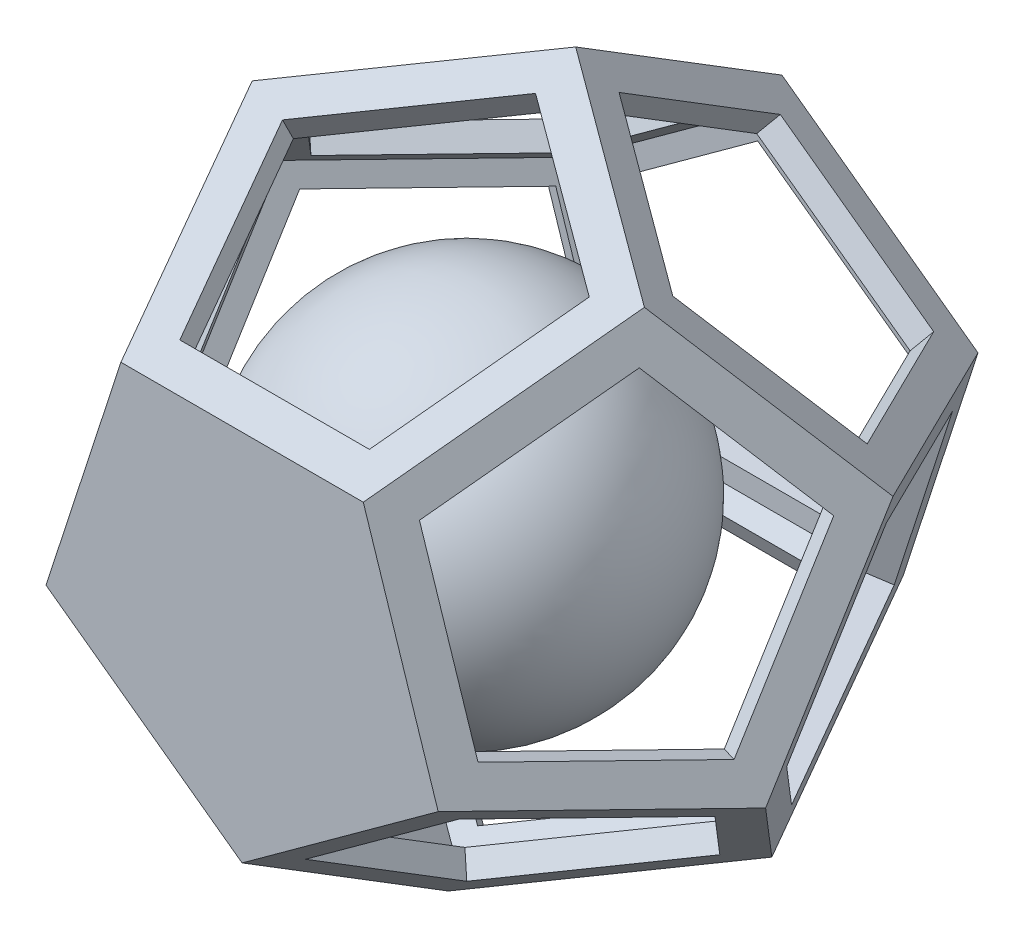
ISO-10303-21;
HEADER;
FILE_DESCRIPTION(('STEP AP214'),'2;1');
FILE_NAME('part.step','',(''),(''),'','','');
FILE_SCHEMA(('AUTOMOTIVE_DESIGN { 1 0 10303 214 1 1 1 1 }'));
ENDSEC;
DATA;
#1=APPLICATION_CONTEXT('core data for automotive mechanical design processes');
#2=APPLICATION_PROTOCOL_DEFINITION('international standard','automotive_design',2000,#1);
#3=PRODUCT_CONTEXT('',#1,'mechanical');
#4=PRODUCT('Part','Part','',(#3));
#5=PRODUCT_RELATED_PRODUCT_CATEGORY('part','',(#4));
#6=PRODUCT_DEFINITION_FORMATION('','',#4);
#7=PRODUCT_DEFINITION_CONTEXT('part definition',#1,'design');
#8=PRODUCT_DEFINITION('design','',#6,#7);
#9=PRODUCT_DEFINITION_SHAPE('','',#8);
#10=(LENGTH_UNIT() NAMED_UNIT(*) SI_UNIT(.MILLI.,.METRE.));
#11=(NAMED_UNIT(*) PLANE_ANGLE_UNIT() SI_UNIT($,.RADIAN.));
#12=(NAMED_UNIT(*) SI_UNIT($,.STERADIAN.) SOLID_ANGLE_UNIT());
#13=UNCERTAINTY_MEASURE_WITH_UNIT(LENGTH_MEASURE(1.E-05),#10,'distance_accuracy_value','');
#14=(GEOMETRIC_REPRESENTATION_CONTEXT(3) GLOBAL_UNCERTAINTY_ASSIGNED_CONTEXT((#13)) GLOBAL_UNIT_ASSIGNED_CONTEXT((#10,
#11,#12)) REPRESENTATION_CONTEXT('',''));
#15=CARTESIAN_POINT('',(0.,0.,0.));
#16=DIRECTION('',(0.,0.,1.));
#17=DIRECTION('',(1.,0.,0.));
#18=AXIS2_PLACEMENT_3D('',#15,#16,#17);
#19=CARTESIAN_POINT('',(0.,0.,26.01232214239));
#20=DIRECTION('',(0.,0.,-1.));
#21=DIRECTION('',(1.,0.,0.));
#22=AXIS2_PLACEMENT_3D('',#19,#20,#21);
#23=SPHERICAL_SURFACE('',#22,15.);
#24=CARTESIAN_POINT('',(0.,0.,11.01232214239));
#25=VERTEX_POINT('',#24);
#26=VERTEX_LOOP('',#25);
#27=FACE_BOUND('',#26,.T.);
#28=ADVANCED_FACE('F79',(#27),#23,.T.);
#29=CLOSED_SHELL('',(#28));
#30=MANIFOLD_SOLID_BREP('B2',#29);
#31=CARTESIAN_POINT('',(15.1289230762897,3.81016003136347,0.894581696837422));
#32=DIRECTION('',(0.525708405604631,0.723575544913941,-0.447290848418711));
#33=DIRECTION('',(-0.809016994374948,0.587785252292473,0.));
#34=AXIS2_PLACEMENT_3D('',#31,#32,#33);
#35=PLANE('',#34);
#36=DIRECTION('',(0.809065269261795,-0.262881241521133,0.525648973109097));
#37=VECTOR('',#36,1.);
#38=CARTESIAN_POINT('',(7.82995277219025,21.5386861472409,20.9951447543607));
#39=LINE('',#38,#37);
#40=CARTESIAN_POINT('',(14.1555099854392,19.4833880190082,25.1048535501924));
#41=VERTEX_POINT('',#40);
#42=CARTESIAN_POINT('',(1.50057771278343,23.5952247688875,16.8829555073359));
#43=VERTEX_POINT('',#42);
#44=EDGE_CURVE('E748',#41,#43,#39,.F.);
#45=ORIENTED_EDGE('',*,*,#44,.F.);
#46=DIRECTION('',(0.500029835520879,-0.688232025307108,-0.525648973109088));
#47=VECTOR('',#46,1.);
#48=CARTESIAN_POINT('',(26.1560548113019,2.96605508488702,12.4894581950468));
#49=LINE('',#48,#47);
#50=CARTESIAN_POINT('',(21.9766882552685,8.7184596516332,16.882955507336));
#51=VERTEX_POINT('',#50);
#52=EDGE_CURVE('E739',#51,#41,#49,.F.);
#53=ORIENTED_EDGE('',*,*,#52,.F.);
#54=DIRECTION('',(-0.50007812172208,-0.162485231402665,-0.850600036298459));
#55=VECTOR('',#54,1.);
#56=CARTESIAN_POINT('',(13.0644684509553,5.82270390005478,1.72385503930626));
#57=LINE('',#56,#55);
#58=CARTESIAN_POINT('',(14.1543943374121,6.17684228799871,3.57774737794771));
#59=VERTEX_POINT('',#58);
#60=EDGE_CURVE('E741',#59,#51,#57,.F.);
#61=ORIENTED_EDGE('',*,*,#60,.F.);
#62=DIRECTION('',(-0.809016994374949,0.587785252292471,0.));
#63=VECTOR('',#62,1.);
#64=CARTESIAN_POINT('',(15.9176559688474,4.89575772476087,3.57774737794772));
#65=LINE('',#64,#63);
#66=CARTESIAN_POINT('',(1.50057771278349,15.3703782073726,3.57774737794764));
#67=VERTEX_POINT('',#66);
#68=EDGE_CURVE('E744',#67,#59,#65,.F.);
#69=ORIENTED_EDGE('',*,*,#68,.F.);
#70=DIRECTION('',(0.,0.525813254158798,0.850600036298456));
#71=VECTOR('',#70,1.);
#72=CARTESIAN_POINT('',(1.50057771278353,10.974149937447,-3.5339636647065));
#73=LINE('',#72,#71);
#74=EDGE_CURVE('E746',#43,#67,#73,.F.);
#75=ORIENTED_EDGE('',*,*,#74,.F.);
#76=EDGE_LOOP('',(#45,#53,#61,#69,#75));
#77=FACE_BOUND('',#76,.T.);
#78=DIRECTION('',(-0.809065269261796,0.262881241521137,-0.525648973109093));
#79=VECTOR('',#78,1.);
#80=CARTESIAN_POINT('',(7.36650856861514,22.6643494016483,22.2714192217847));
#81=LINE('',#80,#79);
#82=CARTESIAN_POINT('',(14.7286482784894,20.2722452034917,27.054594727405));
#83=VERTEX_POINT('',#82);
#84=CARTESIAN_POINT('',(0.,25.0578731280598,17.485405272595));
#85=VERTEX_POINT('',#84);
#86=EDGE_CURVE('E1088',#83,#85,#81,.T.);
#87=ORIENTED_EDGE('',*,*,#86,.T.);
#88=DIRECTION('',(0.,-0.525813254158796,-0.850600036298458));
#89=VECTOR('',#88,1.);
#90=CARTESIAN_POINT('',(0.,15.0131685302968,1.23624071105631));
#91=LINE('',#90,#89);
#92=CARTESIAN_POINT('',(0.,15.4852996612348,2.));
#93=VERTEX_POINT('',#92);
#94=EDGE_CURVE('E1108',#85,#93,#91,.T.);
#95=ORIENTED_EDGE('',*,*,#94,.T.);
#96=DIRECTION('',(0.809016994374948,-0.587785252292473,0.));
#97=VECTOR('',#96,1.);
#98=CARTESIAN_POINT('',(15.4538675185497,4.25740768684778,2.));
#99=LINE('',#98,#97);
#100=CARTESIAN_POINT('',(14.7273951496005,4.78522075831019,2.));
#101=VERTEX_POINT('',#100);
#102=EDGE_CURVE('E1110',#101,#93,#99,.F.);
#103=ORIENTED_EDGE('',*,*,#102,.F.);
#104=DIRECTION('',(-0.500078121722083,-0.162485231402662,-0.850600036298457));
#105=VECTOR('',#104,1.);
#106=CARTESIAN_POINT('',(14.2783717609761,4.63932421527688,1.23624071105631));
#107=LINE('',#106,#105);
#108=CARTESIAN_POINT('',(23.8314535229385,7.74330863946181,17.485405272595));
#109=VERTEX_POINT('',#108);
#110=EDGE_CURVE('E1035',#109,#101,#107,.T.);
#111=ORIENTED_EDGE('',*,*,#110,.F.);
#112=DIRECTION('',(-0.500029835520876,0.688232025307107,0.525648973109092));
#113=VECTOR('',#112,1.);
#114=CARTESIAN_POINT('',(27.3698363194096,2.87314253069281,13.7657326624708));
#115=LINE('',#114,#113);
#116=EDGE_CURVE('E1082',#109,#83,#115,.T.);
#117=ORIENTED_EDGE('',*,*,#116,.T.);
#118=EDGE_LOOP('',(#87,#95,#103,#111,#117));
#119=FACE_BOUND('',#118,.T.);
#120=ADVANCED_FACE('F96',(#77,#119),#35,.F.);
#121=CARTESIAN_POINT('',(1.05141681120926,15.5658650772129,0.894581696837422));
#122=DIRECTION('',(-0.525708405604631,0.723575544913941,-0.447290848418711));
#123=DIRECTION('',(-0.809016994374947,-0.587785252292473,0.));
#124=AXIS2_PLACEMENT_3D('',#121,#122,#123);
#125=PLANE('',#124);
#126=DIRECTION('',(0.500029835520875,0.688232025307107,0.525648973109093));
#127=VECTOR('',#126,1.);
#128=CARTESIAN_POINT('',(-18.0649193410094,14.1025476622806,20.9951447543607));
#129=LINE('',#128,#127);
#130=CARTESIAN_POINT('',(-14.1555099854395,19.483388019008,25.1048535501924));
#131=VERTEX_POINT('',#130);
#132=CARTESIAN_POINT('',(-21.9766882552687,8.71845965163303,16.882955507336));
#133=VERTEX_POINT('',#132);
#134=EDGE_CURVE('E784',#131,#133,#129,.F.);
#135=ORIENTED_EDGE('',*,*,#134,.F.);
#136=DIRECTION('',(0.809065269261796,0.262881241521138,-0.525648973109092));
#137=VECTOR('',#136,1.);
#138=CARTESIAN_POINT('',(5.26177942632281,25.7924477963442,12.4894581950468));
#139=LINE('',#138,#137);
#140=CARTESIAN_POINT('',(-1.50057771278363,23.5952247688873,16.882955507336));
#141=VERTEX_POINT('',#140);
#142=EDGE_CURVE('E767',#141,#131,#139,.F.);
#143=ORIENTED_EDGE('',*,*,#142,.F.);
#144=DIRECTION('',(0.,-0.525813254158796,-0.850600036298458));
#145=VECTOR('',#144,1.);
#146=CARTESIAN_POINT('',(-1.50057771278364,14.2243623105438,1.72385503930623));
#147=LINE('',#146,#145);
#148=CARTESIAN_POINT('',(-1.50057771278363,15.3703782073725,3.57774737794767));
#149=VERTEX_POINT('',#148);
#150=EDGE_CURVE('E777',#149,#141,#147,.F.);
#151=ORIENTED_EDGE('',*,*,#150,.F.);
#152=DIRECTION('',(-0.809016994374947,-0.587785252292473,0.));
#153=VECTOR('',#152,1.);
#154=CARTESIAN_POINT('',(0.262683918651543,16.6514627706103,3.57774737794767));
#155=LINE('',#154,#153);
#156=CARTESIAN_POINT('',(-14.1543943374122,6.1768422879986,3.57774737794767));
#157=VERTEX_POINT('',#156);
#158=EDGE_CURVE('E780',#157,#149,#155,.F.);
#159=ORIENTED_EDGE('',*,*,#158,.F.);
#160=DIRECTION('',(-0.500078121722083,0.162485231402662,0.850600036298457));
#161=VECTOR('',#160,1.);
#162=CARTESIAN_POINT('',(-9.97333279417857,4.81833304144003,-3.5339636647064));
#163=LINE('',#162,#161);
#164=EDGE_CURVE('E782',#133,#157,#163,.F.);
#165=ORIENTED_EDGE('',*,*,#164,.F.);
#166=EDGE_LOOP('',(#135,#143,#151,#159,#165));
#167=FACE_BOUND('',#166,.T.);
#168=DIRECTION('',(-0.809065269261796,-0.262881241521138,0.525648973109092));
#169=VECTOR('',#168,1.);
#170=CARTESIAN_POINT('',(5.72522362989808,26.9181110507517,13.7657326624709));
#171=LINE('',#170,#169);
#172=CARTESIAN_POINT('',(-14.7286482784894,20.2722452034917,27.054594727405));
#173=VERTEX_POINT('',#172);
#174=EDGE_CURVE('E1086',#85,#173,#171,.T.);
#175=ORIENTED_EDGE('',*,*,#174,.T.);
#176=DIRECTION('',(-0.500029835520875,-0.688232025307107,-0.525648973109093));
#177=VECTOR('',#176,1.);
#178=CARTESIAN_POINT('',(-19.278700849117,14.0096351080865,22.2714192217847));
#179=LINE('',#178,#177);
#180=CARTESIAN_POINT('',(-23.8314535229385,7.74330863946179,17.485405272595));
#181=VERTEX_POINT('',#180);
#182=EDGE_CURVE('E1064',#173,#181,#179,.T.);
#183=ORIENTED_EDGE('',*,*,#182,.T.);
#184=DIRECTION('',(0.500078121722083,-0.162485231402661,-0.850600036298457));
#185=VECTOR('',#184,1.);
#186=CARTESIAN_POINT('',(-14.2783717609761,4.63932421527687,1.23624071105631));
#187=LINE('',#186,#185);
#188=CARTESIAN_POINT('',(-14.7273951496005,4.78522075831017,2.));
#189=VERTEX_POINT('',#188);
#190=EDGE_CURVE('E1103',#181,#189,#187,.T.);
#191=ORIENTED_EDGE('',*,*,#190,.T.);
#192=DIRECTION('',(0.809016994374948,0.587785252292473,0.));
#193=VECTOR('',#192,1.);
#194=CARTESIAN_POINT('',(0.726472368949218,16.0131127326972,2.));
#195=LINE('',#194,#193);
#196=EDGE_CURVE('E1105',#93,#189,#195,.F.);
#197=ORIENTED_EDGE('',*,*,#196,.F.);
#198=ORIENTED_EDGE('',*,*,#94,.F.);
#199=EDGE_LOOP('',(#175,#183,#191,#197,#198));
#200=FACE_BOUND('',#199,.T.);
#201=ADVANCED_FACE('F1158',(#167,#200),#125,.F.);
#202=CARTESIAN_POINT('',(-14.4791117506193,5.81007365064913,0.894581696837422));
#203=DIRECTION('',(-0.850614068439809,-0.276381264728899,-0.447290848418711));
#204=DIRECTION('',(-0.465419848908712,0.,0.8850900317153));
#205=AXIS2_PLACEMENT_3D('',#202,#203,#204);
#206=PLANE('',#205);
#207=DIRECTION('',(-0.500029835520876,0.688232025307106,0.525648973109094));
#208=VECTOR('',#207,1.);
#209=CARTESIAN_POINT('',(-18.9946869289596,-12.822832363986,20.9951447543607));
#210=LINE('',#209,#208);
#211=CARTESIAN_POINT('',(-22.9040962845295,-7.44199200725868,25.1048535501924));
#212=VERTEX_POINT('',#211);
#213=CARTESIAN_POINT('',(-15.0829180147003,-18.2069203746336,16.882955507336));
#214=VERTEX_POINT('',#213);
#215=EDGE_CURVE('E737',#212,#214,#210,.F.);
#216=ORIENTED_EDGE('',*,*,#215,.F.);
#217=DIRECTION('',(0.,0.850701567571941,-0.525648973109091));
#218=VECTOR('',#217,1.);
#219=CARTESIAN_POINT('',(-22.9040962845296,12.9745543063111,12.4894581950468));
#220=LINE('',#219,#218);
#221=CARTESIAN_POINT('',(-22.9040962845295,5.86419122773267,16.882955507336));
#222=VERTEX_POINT('',#221);
#223=EDGE_CURVE('E728',#222,#212,#220,.F.);
#224=ORIENTED_EDGE('',*,*,#223,.F.);
#225=DIRECTION('',(0.500078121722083,-0.16248523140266,-0.850600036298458));
#226=VECTOR('',#225,1.);
#227=CARTESIAN_POINT('',(-13.9918764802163,2.96843547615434,1.72385503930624));
#228=LINE('',#227,#226);
#229=CARTESIAN_POINT('',(-15.0818023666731,3.32257386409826,3.57774737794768));
#230=VERTEX_POINT('',#229);
#231=EDGE_CURVE('E730',#230,#222,#228,.F.);
#232=ORIENTED_EDGE('',*,*,#231,.F.);
#233=DIRECTION('',(0.309016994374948,-0.951056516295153,0.));
#234=VECTOR('',#233,1.);
#235=CARTESIAN_POINT('',(-15.7553083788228,5.39541222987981,3.57774737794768));
#236=LINE('',#235,#234);
#237=CARTESIAN_POINT('',(-10.2484745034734,-11.5528797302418,3.57774737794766));
#238=VERTEX_POINT('',#237);
#239=EDGE_CURVE('E733',#238,#230,#236,.F.);
#240=ORIENTED_EDGE('',*,*,#239,.F.);
#241=DIRECTION('',(-0.309065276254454,-0.425391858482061,0.850600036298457));
#242=VECTOR('',#241,1.);
#243=CARTESIAN_POINT('',(-7.66443636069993,-7.9962563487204,-3.53396366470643));
#244=LINE('',#243,#242);
#245=EDGE_CURVE('E735',#214,#238,#244,.F.);
#246=ORIENTED_EDGE('',*,*,#245,.F.);
#247=EDGE_LOOP('',(#216,#224,#232,#240,#246));
#248=FACE_BOUND('',#247,.T.);
#249=DIRECTION('',(0.500029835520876,-0.688232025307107,-0.525648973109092));
#250=VECTOR('',#249,1.);
#251=CARTESIAN_POINT('',(-19.2814009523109,-14.005918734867,22.2714192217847));
#252=LINE('',#251,#250);
#253=CARTESIAN_POINT('',(-23.8314535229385,-7.74330863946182,27.054594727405));
#254=VERTEX_POINT('',#253);
#255=CARTESIAN_POINT('',(-14.7286482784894,-20.2722452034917,17.485405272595));
#256=VERTEX_POINT('',#255);
#257=EDGE_CURVE('E1070',#254,#256,#252,.T.);
#258=ORIENTED_EDGE('',*,*,#257,.T.);
#259=DIRECTION('',(0.309065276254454,0.42539185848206,-0.850600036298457));
#260=VECTOR('',#259,1.);
#261=CARTESIAN_POINT('',(-8.82451905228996,-12.1459084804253,1.23624071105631));
#262=LINE('',#261,#260);
#263=CARTESIAN_POINT('',(-9.10203076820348,-12.5278705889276,2.));
#264=VERTEX_POINT('',#263);
#265=EDGE_CURVE('E1098',#256,#264,#262,.T.);
#266=ORIENTED_EDGE('',*,*,#265,.T.);
#267=DIRECTION('',(-0.309016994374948,0.951056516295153,0.));
#268=VECTOR('',#267,1.);
#269=CARTESIAN_POINT('',(-15.0048829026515,5.63924024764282,2.));
#270=LINE('',#269,#268);
#271=EDGE_CURVE('E1100',#189,#264,#270,.F.);
#272=ORIENTED_EDGE('',*,*,#271,.F.);
#273=ORIENTED_EDGE('',*,*,#190,.F.);
#274=DIRECTION('',(0.,-0.850701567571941,0.525648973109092));
#275=VECTOR('',#274,1.);
#276=CARTESIAN_POINT('',(-23.8314535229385,13.7631650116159,13.7657326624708));
#277=LINE('',#276,#275);
#278=EDGE_CURVE('E1062',#181,#254,#277,.T.);
#279=ORIENTED_EDGE('',*,*,#278,.T.);
#280=EDGE_LOOP('',(#258,#266,#272,#273,#279));
#281=FACE_BOUND('',#280,.T.);
#282=ADVANCED_FACE('F1164',(#248,#281),#206,.F.);
#283=CARTESIAN_POINT('',(-10.,-11.9750420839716,0.894581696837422));
#284=DIRECTION('',(0.,-0.894388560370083,-0.447290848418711));
#285=DIRECTION('',(0.,0.447290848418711,-0.894388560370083));
#286=AXIS2_PLACEMENT_3D('',#283,#284,#285);
#287=PLANE('',#286);
#288=DIRECTION('',(-0.809065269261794,-0.262881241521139,0.525648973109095));
#289=VECTOR('',#288,1.);
#290=CARTESIAN_POINT('',(6.32555721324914,-22.0274938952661,20.9951447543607));
#291=LINE('',#290,#289);
#292=CARTESIAN_POINT('',(1.64139535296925E-13,-24.0827920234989,25.1048535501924));
#293=VERTEX_POINT('',#292);
#294=CARTESIAN_POINT('',(12.6549322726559,-19.9709552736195,16.882955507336));
#295=VERTEX_POINT('',#294);
#296=EDGE_CURVE('E726',#293,#295,#291,.F.);
#297=ORIENTED_EDGE('',*,*,#296,.F.);
#298=DIRECTION('',(-0.809065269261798,0.262881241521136,-0.52564897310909));
#299=VECTOR('',#298,1.);
#300=CARTESIAN_POINT('',(-19.4172894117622,-17.7737322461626,12.4894581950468));
#301=LINE('',#300,#299);
#302=CARTESIAN_POINT('',(-12.6549322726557,-19.9709552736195,16.882955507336));
#303=VERTEX_POINT('',#302);
#304=EDGE_CURVE('E717',#303,#293,#301,.F.);
#305=ORIENTED_EDGE('',*,*,#304,.F.);
#306=DIRECTION('',(0.309065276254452,0.42539185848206,-0.850600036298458));
#307=VECTOR('',#306,1.);
#308=CARTESIAN_POINT('',(-7.14687751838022,-12.3897682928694,1.72385503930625));
#309=LINE('',#308,#307);
#310=CARTESIAN_POINT('',(-7.82048876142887,-13.3169146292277,3.5777473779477));
#311=VERTEX_POINT('',#310);
#312=EDGE_CURVE('E719',#311,#303,#309,.F.);
#313=ORIENTED_EDGE('',*,*,#312,.F.);
#314=DIRECTION('',(1.,0.,0.));
#315=VECTOR('',#314,1.);
#316=CARTESIAN_POINT('',(-10.,-13.3169146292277,3.5777473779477));
#317=LINE('',#316,#315);
#318=CARTESIAN_POINT('',(7.82048876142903,-13.3169146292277,3.57774737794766));
#319=VERTEX_POINT('',#318);
#320=EDGE_CURVE('E722',#319,#311,#317,.F.);
#321=ORIENTED_EDGE('',*,*,#320,.F.);
#322=DIRECTION('',(0.309065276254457,-0.42539185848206,0.850600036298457));
#323=VECTOR('',#322,1.);
#324=CARTESIAN_POINT('',(5.2364506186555,-9.76029124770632,-3.53396366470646));
#325=LINE('',#324,#323);
#326=EDGE_CURVE('E724',#295,#319,#325,.F.);
#327=ORIENTED_EDGE('',*,*,#326,.F.);
#328=EDGE_LOOP('',(#297,#305,#313,#321,#327));
#329=FACE_BOUND('',#328,.T.);
#330=DIRECTION('',(0.809065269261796,0.262881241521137,-0.525648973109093));
#331=VECTOR('',#330,1.);
#332=CARTESIAN_POINT('',(7.36213970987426,-22.6657689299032,22.2714192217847));
#333=LINE('',#332,#331);
#334=CARTESIAN_POINT('',(0.,-25.0578731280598,27.054594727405));
#335=VERTEX_POINT('',#334);
#336=CARTESIAN_POINT('',(14.7286482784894,-20.2722452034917,17.485405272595));
#337=VERTEX_POINT('',#336);
#338=EDGE_CURVE('E1076',#335,#337,#333,.T.);
#339=ORIENTED_EDGE('',*,*,#338,.T.);
#340=DIRECTION('',(-0.309065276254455,0.42539185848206,-0.850600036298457));
#341=VECTOR('',#340,1.);
#342=CARTESIAN_POINT('',(8.82451905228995,-12.1459084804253,1.23624071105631));
#343=LINE('',#342,#341);
#344=CARTESIAN_POINT('',(9.10203076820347,-12.5278705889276,2.));
#345=VERTEX_POINT('',#344);
#346=EDGE_CURVE('E1093',#337,#345,#343,.T.);
#347=ORIENTED_EDGE('',*,*,#346,.T.);
#348=DIRECTION('',(-1.,0.,0.));
#349=VECTOR('',#348,1.);
#350=CARTESIAN_POINT('',(-10.,-12.5278705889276,2.));
#351=LINE('',#350,#349);
#352=EDGE_CURVE('E1095',#264,#345,#351,.F.);
#353=ORIENTED_EDGE('',*,*,#352,.F.);
#354=ORIENTED_EDGE('',*,*,#265,.F.);
#355=DIRECTION('',(0.809065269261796,-0.262881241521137,0.525648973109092));
#356=VECTOR('',#355,1.);
#357=CARTESIAN_POINT('',(-20.4538719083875,-18.4120072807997,13.7657326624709));
#358=LINE('',#357,#356);
#359=EDGE_CURVE('E1068',#256,#335,#358,.T.);
#360=ORIENTED_EDGE('',*,*,#359,.T.);
#361=EDGE_LOOP('',(#339,#347,#353,#354,#360));
#362=FACE_BOUND('',#361,.T.);
#363=ADVANCED_FACE('F1175',(#329,#362),#287,.F.);
#364=CARTESIAN_POINT('',(8.29877186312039,-13.2110566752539,0.894581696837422));
#365=DIRECTION('',(0.850614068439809,-0.276381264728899,-0.447290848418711));
#366=DIRECTION('',(-0.465419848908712,0.,-0.885090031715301));
#367=AXIS2_PLACEMENT_3D('',#364,#365,#366);
#368=PLANE('',#367);
#369=DIRECTION('',(0.,-0.850701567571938,0.525648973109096));
#370=VECTOR('',#369,1.);
#371=CARTESIAN_POINT('',(22.9040962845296,-0.790907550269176,20.9951447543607));
#372=LINE('',#371,#370);
#373=CARTESIAN_POINT('',(22.9040962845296,-7.44199200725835,25.1048535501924));
#374=VERTEX_POINT('',#373);
#375=CARTESIAN_POINT('',(22.9040962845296,5.86419122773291,16.882955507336));
#376=VERTEX_POINT('',#375);
#377=EDGE_CURVE('E715',#374,#376,#372,.F.);
#378=ORIENTED_EDGE('',*,*,#377,.F.);
#379=DIRECTION('',(-0.500029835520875,-0.688232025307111,-0.525648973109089));
#380=VECTOR('',#379,1.);
#381=CARTESIAN_POINT('',(10.9035514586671,-23.9593249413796,12.4894581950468));
#382=LINE('',#381,#380);
#383=CARTESIAN_POINT('',(15.0829180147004,-18.2069203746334,16.882955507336));
#384=VERTEX_POINT('',#383);
#385=EDGE_CURVE('E698',#384,#374,#382,.F.);
#386=ORIENTED_EDGE('',*,*,#385,.F.);
#387=DIRECTION('',(-0.309065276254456,0.425391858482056,-0.850600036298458));
#388=VECTOR('',#387,1.);
#389=CARTESIAN_POINT('',(9.57486326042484,-10.6257333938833,1.72385503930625));
#390=LINE('',#389,#388);
#391=CARTESIAN_POINT('',(10.2484745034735,-11.5528797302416,3.5777473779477));
#392=VERTEX_POINT('',#391);
#393=EDGE_CURVE('E708',#392,#384,#390,.F.);
#394=ORIENTED_EDGE('',*,*,#393,.F.);
#395=DIRECTION('',(0.309016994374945,0.951056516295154,0.));
#396=VECTOR('',#395,1.);
#397=CARTESIAN_POINT('',(9.57496849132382,-13.6257180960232,3.57774737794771));
#398=LINE('',#397,#396);
#399=CARTESIAN_POINT('',(15.0818023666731,3.32257386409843,3.57774737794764));
#400=VERTEX_POINT('',#399);
#401=EDGE_CURVE('E711',#400,#392,#398,.F.);
#402=ORIENTED_EDGE('',*,*,#401,.F.);
#403=DIRECTION('',(0.500078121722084,0.162485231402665,0.850600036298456));
#404=VECTOR('',#403,1.);
#405=CARTESIAN_POINT('',(10.9007408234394,1.96406461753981,-3.53396366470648));
#406=LINE('',#405,#404);
#407=EDGE_CURVE('E713',#376,#400,#406,.F.);
#408=ORIENTED_EDGE('',*,*,#407,.F.);
#409=EDGE_LOOP('',(#378,#386,#394,#402,#408));
#410=FACE_BOUND('',#409,.T.);
#411=DIRECTION('',(0.,0.850701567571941,-0.525648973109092));
#412=VECTOR('',#411,1.);
#413=CARTESIAN_POINT('',(23.8314535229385,-0.00229684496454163,22.2714192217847));
#414=LINE('',#413,#412);
#415=CARTESIAN_POINT('',(23.8314535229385,-7.74330863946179,27.054594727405));
#416=VERTEX_POINT('',#415);
#417=EDGE_CURVE('E1078',#416,#109,#414,.T.);
#418=ORIENTED_EDGE('',*,*,#417,.T.);
#419=ORIENTED_EDGE('',*,*,#110,.T.);
#420=DIRECTION('',(-0.309016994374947,-0.951056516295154,0.));
#421=VECTOR('',#420,1.);
#422=CARTESIAN_POINT('',(8.82454301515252,-13.3818900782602,2.));
#423=LINE('',#422,#421);
#424=EDGE_CURVE('E1090',#345,#101,#423,.F.);
#425=ORIENTED_EDGE('',*,*,#424,.F.);
#426=ORIENTED_EDGE('',*,*,#346,.F.);
#427=DIRECTION('',(0.500029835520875,0.688232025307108,0.525648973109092));
#428=VECTOR('',#427,1.);
#429=CARTESIAN_POINT('',(11.1902654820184,-25.1424113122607,13.7657326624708));
#430=LINE('',#429,#428);
#431=EDGE_CURVE('E1074',#337,#416,#430,.T.);
#432=ORIENTED_EDGE('',*,*,#431,.T.);
#433=EDGE_LOOP('',(#418,#419,#425,#426,#432));
#434=FACE_BOUND('',#433,.T.);
#435=ADVANCED_FACE('F1179',(#410,#434),#368,.F.);
#436=CARTESIAN_POINT('',(0.,0.,2.));
#437=DIRECTION('',(0.,0.,1.));
#438=DIRECTION('',(1.,0.,0.));
#439=AXIS2_PLACEMENT_3D('',#436,#437,#438);
#440=PLANE('',#439);
#441=DIRECTION('',(-0.809016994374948,-0.587785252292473,0.));
#442=VECTOR('',#441,1.);
#443=CARTESIAN_POINT('',(-6.32681418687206,8.70811266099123,2.));
#444=LINE('',#443,#442);
#445=CARTESIAN_POINT('',(0.,13.3048122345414,2.));
#446=VERTEX_POINT('',#445);
#447=CARTESIAN_POINT('',(-12.6536283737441,4.11141308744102,2.));
#448=VERTEX_POINT('',#447);
#449=EDGE_CURVE('E604',#446,#448,#444,.T.);
#450=ORIENTED_EDGE('',*,*,#449,.F.);
#451=DIRECTION('',(-0.809016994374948,0.587785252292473,0.));
#452=VECTOR('',#451,1.);
#453=CARTESIAN_POINT('',(6.32681418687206,8.70811266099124,2.));
#454=LINE('',#453,#452);
#455=CARTESIAN_POINT('',(12.6536283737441,4.11141308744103,2.));
#456=VERTEX_POINT('',#455);
#457=EDGE_CURVE('E593',#456,#446,#454,.T.);
#458=ORIENTED_EDGE('',*,*,#457,.F.);
#459=DIRECTION('',(0.309016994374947,0.951056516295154,0.));
#460=VECTOR('',#459,1.);
#461=CARTESIAN_POINT('',(10.237000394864,-3.32620305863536,2.));
#462=LINE('',#461,#460);
#463=CARTESIAN_POINT('',(7.82037241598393,-10.7638192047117,2.));
#464=VERTEX_POINT('',#463);
#465=EDGE_CURVE('E569',#464,#456,#462,.T.);
#466=ORIENTED_EDGE('',*,*,#465,.F.);
#467=DIRECTION('',(1.,0.,0.));
#468=VECTOR('',#467,1.);
#469=CARTESIAN_POINT('',(0.,-10.7638192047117,2.));
#470=LINE('',#469,#468);
#471=CARTESIAN_POINT('',(-7.82037241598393,-10.7638192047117,2.));
#472=VERTEX_POINT('',#471);
#473=EDGE_CURVE('E600',#472,#464,#470,.T.);
#474=ORIENTED_EDGE('',*,*,#473,.F.);
#475=DIRECTION('',(0.309016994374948,-0.951056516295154,0.));
#476=VECTOR('',#475,1.);
#477=CARTESIAN_POINT('',(-10.237000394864,-3.32620305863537,2.));
#478=LINE('',#477,#476);
#479=EDGE_CURVE('E602',#448,#472,#478,.T.);
#480=ORIENTED_EDGE('',*,*,#479,.F.);
#481=EDGE_LOOP('',(#450,#458,#466,#474,#480));
#482=FACE_BOUND('',#481,.T.);
#483=ORIENTED_EDGE('',*,*,#102,.T.);
#484=ORIENTED_EDGE('',*,*,#196,.T.);
#485=ORIENTED_EDGE('',*,*,#271,.T.);
#486=ORIENTED_EDGE('',*,*,#352,.T.);
#487=ORIENTED_EDGE('',*,*,#424,.T.);
#488=EDGE_LOOP('',(#483,#484,#485,#486,#487));
#489=FACE_BOUND('',#488,.T.);
#490=ADVANCED_FACE('F1183',(#482,#489),#440,.T.);
#491=CARTESIAN_POINT('',(9.99999999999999,11.9750420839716,43.6454183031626));
#492=DIRECTION('',(0.,-0.894388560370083,-0.447290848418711));
#493=DIRECTION('',(0.,0.447290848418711,-0.894388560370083));
#494=AXIS2_PLACEMENT_3D('',#491,#492,#493);
#495=PLANE('',#494);
#496=DIRECTION('',(-1.,0.,0.));
#497=VECTOR('',#496,1.);
#498=CARTESIAN_POINT('',(9.99999999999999,13.3169146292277,40.9622526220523));
#499=LINE('',#498,#497);
#500=CARTESIAN_POINT('',(-7.82048876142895,13.3169146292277,40.9622526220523));
#501=VERTEX_POINT('',#500);
#502=CARTESIAN_POINT('',(7.82048876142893,13.3169146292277,40.9622526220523));
#503=VERTEX_POINT('',#502);
#504=EDGE_CURVE('E104',#501,#503,#499,.F.);
#505=ORIENTED_EDGE('',*,*,#504,.T.);
#506=DIRECTION('',(-0.309065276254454,-0.42539185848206,0.850600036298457));
#507=VECTOR('',#506,1.);
#508=CARTESIAN_POINT('',(7.14687751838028,12.3897682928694,42.8161449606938));
#509=LINE('',#508,#507);
#510=CARTESIAN_POINT('',(12.6549322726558,19.9709552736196,27.657044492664));
#511=VERTEX_POINT('',#510);
#512=EDGE_CURVE('E77',#503,#511,#509,.F.);
#513=ORIENTED_EDGE('',*,*,#512,.T.);
#514=DIRECTION('',(0.809065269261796,-0.262881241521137,0.525648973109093));
#515=VECTOR('',#514,1.);
#516=CARTESIAN_POINT('',(19.4172894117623,17.7737322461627,32.0505418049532));
#517=LINE('',#516,#515);
#518=CARTESIAN_POINT('',(0.,24.0827920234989,19.4351464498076));
#519=VERTEX_POINT('',#518);
#520=EDGE_CURVE('E1046',#511,#519,#517,.F.);
#521=ORIENTED_EDGE('',*,*,#520,.T.);
#522=DIRECTION('',(0.809065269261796,0.262881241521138,-0.525648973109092));
#523=VECTOR('',#522,1.);
#524=CARTESIAN_POINT('',(-6.32555721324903,22.0274938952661,23.5448552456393));
#525=LINE('',#524,#523);
#526=CARTESIAN_POINT('',(-12.6549322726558,19.9709552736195,27.657044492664));
#527=VERTEX_POINT('',#526);
#528=EDGE_CURVE('E1116',#519,#527,#525,.F.);
#529=ORIENTED_EDGE('',*,*,#528,.T.);
#530=DIRECTION('',(-0.309065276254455,0.425391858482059,-0.850600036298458));
#531=VECTOR('',#530,1.);
#532=CARTESIAN_POINT('',(-5.23645061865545,9.76029124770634,48.0739636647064));
#533=LINE('',#532,#531);
#534=EDGE_CURVE('E1119',#527,#501,#533,.F.);
#535=ORIENTED_EDGE('',*,*,#534,.T.);
#536=EDGE_LOOP('',(#505,#513,#521,#529,#535));
#537=FACE_BOUND('',#536,.T.);
#538=ORIENTED_EDGE('',*,*,#86,.F.);
#539=DIRECTION('',(-0.309065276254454,-0.42539185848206,0.850600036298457));
#540=VECTOR('',#539,1.);
#541=CARTESIAN_POINT('',(6.91409215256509,9.51643143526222,48.5615779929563));
#542=LINE('',#541,#540);
#543=CARTESIAN_POINT('',(9.10203076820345,12.5278705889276,42.54));
#544=VERTEX_POINT('',#543);
#545=EDGE_CURVE('E1080',#83,#544,#542,.T.);
#546=ORIENTED_EDGE('',*,*,#545,.T.);
#547=DIRECTION('',(1.,0.,0.));
#548=VECTOR('',#547,1.);
#549=CARTESIAN_POINT('',(0.,12.5278705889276,42.54));
#550=LINE('',#549,#548);
#551=CARTESIAN_POINT('',(-9.10203076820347,12.5278705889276,42.54));
#552=VERTEX_POINT('',#551);
#553=EDGE_CURVE('E1053',#544,#552,#550,.F.);
#554=ORIENTED_EDGE('',*,*,#553,.T.);
#555=DIRECTION('',(0.309065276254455,-0.425391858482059,0.850600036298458));
#556=VECTOR('',#555,1.);
#557=CARTESIAN_POINT('',(-6.9140921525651,9.51643143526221,48.5615779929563));
#558=LINE('',#557,#556);
#559=EDGE_CURVE('E1084',#173,#552,#558,.T.);
#560=ORIENTED_EDGE('',*,*,#559,.F.);
#561=ORIENTED_EDGE('',*,*,#174,.F.);
#562=EDGE_LOOP('',(#538,#546,#554,#560,#561));
#563=FACE_BOUND('',#562,.T.);
#564=ADVANCED_FACE('F1123',(#537,#563),#495,.T.);
#565=CARTESIAN_POINT('',(14.4791117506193,-5.81007365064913,43.6454183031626));
#566=DIRECTION('',(-0.850614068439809,-0.2763812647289,-0.447290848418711));
#567=DIRECTION('',(-0.465419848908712,0.,0.8850900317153));
#568=AXIS2_PLACEMENT_3D('',#565,#566,#567);
#569=PLANE('',#568);
#570=DIRECTION('',(-0.30901699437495,0.951056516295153,0.));
#571=VECTOR('',#570,1.);
#572=CARTESIAN_POINT('',(15.7553083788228,-5.39541222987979,40.9622526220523));
#573=LINE('',#572,#571);
#574=CARTESIAN_POINT('',(10.2484745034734,11.5528797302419,40.9622526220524));
#575=VERTEX_POINT('',#574);
#576=CARTESIAN_POINT('',(15.0818023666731,-3.32257386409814,40.9622526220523));
#577=VERTEX_POINT('',#576);
#578=EDGE_CURVE('E940',#575,#577,#573,.F.);
#579=ORIENTED_EDGE('',*,*,#578,.T.);
#580=DIRECTION('',(-0.500078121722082,0.162485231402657,0.850600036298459));
#581=VECTOR('',#580,1.);
#582=CARTESIAN_POINT('',(13.9918764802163,-2.96843547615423,42.8161449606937));
#583=LINE('',#582,#581);
#584=CARTESIAN_POINT('',(22.9040962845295,-5.8641912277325,27.6570444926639));
#585=VERTEX_POINT('',#584);
#586=EDGE_CURVE('E943',#577,#585,#583,.F.);
#587=ORIENTED_EDGE('',*,*,#586,.T.);
#588=DIRECTION('',(0.,-0.850701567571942,0.525648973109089));
#589=VECTOR('',#588,1.);
#590=CARTESIAN_POINT('',(22.9040962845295,-12.974554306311,32.0505418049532));
#591=LINE('',#590,#589);
#592=CARTESIAN_POINT('',(22.9040962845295,7.44199200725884,19.4351464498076));
#593=VERTEX_POINT('',#592);
#594=EDGE_CURVE('E931',#585,#593,#591,.F.);
#595=ORIENTED_EDGE('',*,*,#594,.T.);
#596=DIRECTION('',(0.500029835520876,-0.688232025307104,-0.525648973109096));
#597=VECTOR('',#596,1.);
#598=CARTESIAN_POINT('',(18.9946869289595,12.8228323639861,23.5448552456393));
#599=LINE('',#598,#597);
#600=CARTESIAN_POINT('',(15.0829180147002,18.2069203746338,27.657044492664));
#601=VERTEX_POINT('',#600);
#602=EDGE_CURVE('E934',#593,#601,#599,.F.);
#603=ORIENTED_EDGE('',*,*,#602,.T.);
#604=DIRECTION('',(0.309065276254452,0.425391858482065,-0.850600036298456));
#605=VECTOR('',#604,1.);
#606=CARTESIAN_POINT('',(7.66443636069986,7.99625634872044,48.0739636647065));
#607=LINE('',#606,#605);
#608=EDGE_CURVE('E937',#601,#575,#607,.F.);
#609=ORIENTED_EDGE('',*,*,#608,.T.);
#610=EDGE_LOOP('',(#579,#587,#595,#603,#609));
#611=FACE_BOUND('',#610,.T.);
#612=ORIENTED_EDGE('',*,*,#116,.F.);
#613=ORIENTED_EDGE('',*,*,#417,.F.);
#614=DIRECTION('',(-0.500078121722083,0.162485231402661,0.850600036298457));
#615=VECTOR('',#614,1.);
#616=CARTESIAN_POINT('',(11.1872361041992,-3.63495335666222,48.5615779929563));
#617=LINE('',#616,#615);
#618=CARTESIAN_POINT('',(14.7273951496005,-4.78522075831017,42.54));
#619=VERTEX_POINT('',#618);
#620=EDGE_CURVE('E1072',#416,#619,#617,.T.);
#621=ORIENTED_EDGE('',*,*,#620,.T.);
#622=DIRECTION('',(0.309016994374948,-0.951056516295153,0.));
#623=VECTOR('',#622,1.);
#624=CARTESIAN_POINT('',(11.914712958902,3.87132491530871,42.54));
#625=LINE('',#624,#623);
#626=EDGE_CURVE('E1056',#619,#544,#625,.F.);
#627=ORIENTED_EDGE('',*,*,#626,.T.);
#628=ORIENTED_EDGE('',*,*,#545,.F.);
#629=EDGE_LOOP('',(#612,#613,#621,#627,#628));
#630=FACE_BOUND('',#629,.T.);
#631=ADVANCED_FACE('F1190',(#611,#630),#569,.T.);
#632=CARTESIAN_POINT('',(-1.05141681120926,-15.5658650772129,43.6454183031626));
#633=DIRECTION('',(-0.525708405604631,0.72357554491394,-0.447290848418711));
#634=DIRECTION('',(-0.809016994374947,-0.587785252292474,0.));
#635=AXIS2_PLACEMENT_3D('',#632,#633,#634);
#636=PLANE('',#635);
#637=DIRECTION('',(0.809016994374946,0.587785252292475,0.));
#638=VECTOR('',#637,1.);
#639=CARTESIAN_POINT('',(-0.262683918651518,-16.6514627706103,40.9622526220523));
#640=LINE('',#639,#638);
#641=CARTESIAN_POINT('',(14.1543943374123,-6.17684228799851,40.9622526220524));
#642=VERTEX_POINT('',#641);
#643=CARTESIAN_POINT('',(1.50057771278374,-15.3703782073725,40.9622526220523));
#644=VERTEX_POINT('',#643);
#645=EDGE_CURVE('E925',#642,#644,#640,.F.);
#646=ORIENTED_EDGE('',*,*,#645,.T.);
#647=DIRECTION('',(0.,0.525813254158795,0.850600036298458));
#648=VECTOR('',#647,1.);
#649=CARTESIAN_POINT('',(1.50057771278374,-14.2243623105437,42.8161449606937));
#650=LINE('',#649,#648);
#651=CARTESIAN_POINT('',(1.5005777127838,-23.5952247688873,27.6570444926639));
#652=VERTEX_POINT('',#651);
#653=EDGE_CURVE('E928',#644,#652,#650,.F.);
#654=ORIENTED_EDGE('',*,*,#653,.T.);
#655=DIRECTION('',(-0.809065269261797,-0.26288124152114,0.52564897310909));
#656=VECTOR('',#655,1.);
#657=CARTESIAN_POINT('',(-5.26177942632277,-25.7924477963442,32.0505418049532));
#658=LINE('',#657,#656);
#659=CARTESIAN_POINT('',(14.1555099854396,-19.4833880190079,19.4351464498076));
#660=VERTEX_POINT('',#659);
#661=EDGE_CURVE('E916',#652,#660,#658,.F.);
#662=ORIENTED_EDGE('',*,*,#661,.T.);
#663=DIRECTION('',(-0.500029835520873,-0.688232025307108,-0.525648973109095));
#664=VECTOR('',#663,1.);
#665=CARTESIAN_POINT('',(18.0649193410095,-14.1025476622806,23.5448552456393));
#666=LINE('',#665,#664);
#667=CARTESIAN_POINT('',(21.9766882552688,-8.71845965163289,27.657044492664));
#668=VERTEX_POINT('',#667);
#669=EDGE_CURVE('E919',#660,#668,#666,.F.);
#670=ORIENTED_EDGE('',*,*,#669,.T.);
#671=DIRECTION('',(0.500078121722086,-0.162485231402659,-0.850600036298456));
#672=VECTOR('',#671,1.);
#673=CARTESIAN_POINT('',(9.97333279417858,-4.81833304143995,48.0739636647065));
#674=LINE('',#673,#672);
#675=EDGE_CURVE('E922',#668,#642,#674,.F.);
#676=ORIENTED_EDGE('',*,*,#675,.T.);
#677=EDGE_LOOP('',(#646,#654,#662,#670,#676));
#678=FACE_BOUND('',#677,.T.);
#679=ORIENTED_EDGE('',*,*,#338,.F.);
#680=DIRECTION('',(0.,0.525813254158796,0.850600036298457));
#681=VECTOR('',#680,1.);
#682=CARTESIAN_POINT('',(0.,-11.7629561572,48.5615779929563));
#683=LINE('',#682,#681);
#684=CARTESIAN_POINT('',(0.,-15.4852996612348,42.54));
#685=VERTEX_POINT('',#684);
#686=EDGE_CURVE('E1066',#335,#685,#683,.T.);
#687=ORIENTED_EDGE('',*,*,#686,.T.);
#688=DIRECTION('',(-0.809016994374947,-0.587785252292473,0.));
#689=VECTOR('',#688,1.);
#690=CARTESIAN_POINT('',(7.36369757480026,-10.1352602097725,42.54));
#691=LINE('',#690,#689);
#692=EDGE_CURVE('E1043',#685,#619,#691,.F.);
#693=ORIENTED_EDGE('',*,*,#692,.T.);
#694=ORIENTED_EDGE('',*,*,#620,.F.);
#695=ORIENTED_EDGE('',*,*,#431,.F.);
#696=EDGE_LOOP('',(#679,#687,#693,#694,#695));
#697=FACE_BOUND('',#696,.T.);
#698=ADVANCED_FACE('F1193',(#678,#697),#636,.T.);
#699=CARTESIAN_POINT('',(-15.1289230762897,-3.81016003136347,43.6454183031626));
#700=DIRECTION('',(0.525708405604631,0.723575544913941,-0.447290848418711));
#701=DIRECTION('',(-0.809016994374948,0.587785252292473,0.));
#702=AXIS2_PLACEMENT_3D('',#699,#700,#701);
#703=PLANE('',#702);
#704=DIRECTION('',(0.809016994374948,-0.587785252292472,0.));
#705=VECTOR('',#704,1.);
#706=CARTESIAN_POINT('',(-15.9176559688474,-4.89575772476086,40.9622526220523));
#707=LINE('',#706,#705);
#708=CARTESIAN_POINT('',(-1.50057771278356,-15.3703782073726,40.9622526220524));
#709=VERTEX_POINT('',#708);
#710=CARTESIAN_POINT('',(-14.1543943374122,-6.17684228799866,40.9622526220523));
#711=VERTEX_POINT('',#710);
#712=EDGE_CURVE('E910',#709,#711,#707,.F.);
#713=ORIENTED_EDGE('',*,*,#712,.T.);
#714=DIRECTION('',(0.500078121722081,0.162485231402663,0.850600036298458));
#715=VECTOR('',#714,1.);
#716=CARTESIAN_POINT('',(-13.0644684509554,-5.82270390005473,42.8161449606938));
#717=LINE('',#716,#715);
#718=CARTESIAN_POINT('',(-21.9766882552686,-8.71845965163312,27.6570444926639));
#719=VERTEX_POINT('',#718);
#720=EDGE_CURVE('E913',#711,#719,#717,.F.);
#721=ORIENTED_EDGE('',*,*,#720,.T.);
#722=DIRECTION('',(-0.500029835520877,0.688232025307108,0.525648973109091));
#723=VECTOR('',#722,1.);
#724=CARTESIAN_POINT('',(-26.1560548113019,-2.96605508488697,32.0505418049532));
#725=LINE('',#724,#723);
#726=CARTESIAN_POINT('',(-14.1555099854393,-19.4833880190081,19.4351464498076));
#727=VERTEX_POINT('',#726);
#728=EDGE_CURVE('E901',#719,#727,#725,.F.);
#729=ORIENTED_EDGE('',*,*,#728,.T.);
#730=DIRECTION('',(-0.809065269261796,0.262881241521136,-0.525648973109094));
#731=VECTOR('',#730,1.);
#732=CARTESIAN_POINT('',(-7.82995277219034,-21.5386861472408,23.5448552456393));
#733=LINE('',#732,#731);
#734=CARTESIAN_POINT('',(-1.50057771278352,-23.5952247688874,27.657044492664));
#735=VERTEX_POINT('',#734);
#736=EDGE_CURVE('E904',#727,#735,#733,.F.);
#737=ORIENTED_EDGE('',*,*,#736,.T.);
#738=DIRECTION('',(0.,-0.525813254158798,-0.850600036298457));
#739=VECTOR('',#738,1.);
#740=CARTESIAN_POINT('',(-1.50057771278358,-10.974149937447,48.0739636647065));
#741=LINE('',#740,#739);
#742=EDGE_CURVE('E907',#735,#709,#741,.F.);
#743=ORIENTED_EDGE('',*,*,#742,.T.);
#744=EDGE_LOOP('',(#713,#721,#729,#737,#743));
#745=FACE_BOUND('',#744,.T.);
#746=ORIENTED_EDGE('',*,*,#257,.F.);
#747=DIRECTION('',(0.500078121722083,0.162485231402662,0.850600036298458));
#748=VECTOR('',#747,1.);
#749=CARTESIAN_POINT('',(-11.1872361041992,-3.63495335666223,48.5615779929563));
#750=LINE('',#749,#748);
#751=CARTESIAN_POINT('',(-14.7273951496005,-4.78522075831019,42.54));
#752=VERTEX_POINT('',#751);
#753=EDGE_CURVE('E1059',#254,#752,#750,.T.);
#754=ORIENTED_EDGE('',*,*,#753,.T.);
#755=DIRECTION('',(-0.809016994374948,0.587785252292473,0.));
#756=VECTOR('',#755,1.);
#757=CARTESIAN_POINT('',(-7.36369757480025,-10.1352602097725,42.54));
#758=LINE('',#757,#756);
#759=EDGE_CURVE('E1047',#752,#685,#758,.F.);
#760=ORIENTED_EDGE('',*,*,#759,.T.);
#761=ORIENTED_EDGE('',*,*,#686,.F.);
#762=ORIENTED_EDGE('',*,*,#359,.F.);
#763=EDGE_LOOP('',(#746,#754,#760,#761,#762));
#764=FACE_BOUND('',#763,.T.);
#765=ADVANCED_FACE('F1197',(#745,#764),#703,.T.);
#766=CARTESIAN_POINT('',(-8.29877186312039,13.2110566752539,43.6454183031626));
#767=DIRECTION('',(0.850614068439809,-0.276381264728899,-0.447290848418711));
#768=DIRECTION('',(-0.465419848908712,0.,-0.885090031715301));
#769=AXIS2_PLACEMENT_3D('',#766,#767,#768);
#770=PLANE('',#769);
#771=DIRECTION('',(-0.309016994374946,-0.951056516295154,0.));
#772=VECTOR('',#771,1.);
#773=CARTESIAN_POINT('',(-9.57496849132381,13.6257180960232,40.9622526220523));
#774=LINE('',#773,#772);
#775=CARTESIAN_POINT('',(-15.0818023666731,-3.32257386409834,40.9622526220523));
#776=VERTEX_POINT('',#775);
#777=CARTESIAN_POINT('',(-10.2484745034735,11.5528797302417,40.9622526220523));
#778=VERTEX_POINT('',#777);
#779=EDGE_CURVE('E895',#776,#778,#774,.F.);
#780=ORIENTED_EDGE('',*,*,#779,.T.);
#781=DIRECTION('',(0.309065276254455,-0.425391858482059,0.850600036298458));
#782=VECTOR('',#781,1.);
#783=CARTESIAN_POINT('',(-9.5748632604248,10.6257333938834,42.8161449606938));
#784=LINE('',#783,#782);
#785=CARTESIAN_POINT('',(-15.0829180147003,18.2069203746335,27.657044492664));
#786=VERTEX_POINT('',#785);
#787=EDGE_CURVE('E898',#778,#786,#784,.F.);
#788=ORIENTED_EDGE('',*,*,#787,.T.);
#789=DIRECTION('',(0.500029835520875,0.688232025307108,0.525648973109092));
#790=VECTOR('',#789,1.);
#791=CARTESIAN_POINT('',(-10.903551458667,23.9593249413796,32.0505418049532));
#792=LINE('',#791,#790);
#793=CARTESIAN_POINT('',(-22.9040962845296,7.44199200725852,19.4351464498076));
#794=VERTEX_POINT('',#793);
#795=EDGE_CURVE('E878',#786,#794,#792,.F.);
#796=ORIENTED_EDGE('',*,*,#795,.T.);
#797=DIRECTION('',(0.,0.85070156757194,-0.525648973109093));
#798=VECTOR('',#797,1.);
#799=CARTESIAN_POINT('',(-22.9040962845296,0.790907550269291,23.5448552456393));
#800=LINE('',#799,#798);
#801=CARTESIAN_POINT('',(-22.9040962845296,-5.86419122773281,27.657044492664));
#802=VERTEX_POINT('',#801);
#803=EDGE_CURVE('E889',#794,#802,#800,.F.);
#804=ORIENTED_EDGE('',*,*,#803,.T.);
#805=DIRECTION('',(-0.500078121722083,-0.162485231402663,-0.850600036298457));
#806=VECTOR('',#805,1.);
#807=CARTESIAN_POINT('',(-10.9007408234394,-1.96406461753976,48.0739636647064));
#808=LINE('',#807,#806);
#809=EDGE_CURVE('E892',#802,#776,#808,.F.);
#810=ORIENTED_EDGE('',*,*,#809,.T.);
#811=EDGE_LOOP('',(#780,#788,#796,#804,#810));
#812=FACE_BOUND('',#811,.T.);
#813=ORIENTED_EDGE('',*,*,#182,.F.);
#814=ORIENTED_EDGE('',*,*,#559,.T.);
#815=DIRECTION('',(0.309016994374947,0.951056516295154,0.));
#816=VECTOR('',#815,1.);
#817=CARTESIAN_POINT('',(-11.914712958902,3.87132491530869,42.54));
#818=LINE('',#817,#816);
#819=EDGE_CURVE('E1050',#552,#752,#818,.F.);
#820=ORIENTED_EDGE('',*,*,#819,.T.);
#821=ORIENTED_EDGE('',*,*,#753,.F.);
#822=ORIENTED_EDGE('',*,*,#278,.F.);
#823=EDGE_LOOP('',(#813,#814,#820,#821,#822));
#824=FACE_BOUND('',#823,.T.);
#825=ADVANCED_FACE('F1200',(#812,#824),#770,.T.);
#826=CARTESIAN_POINT('',(0.,0.,42.54));
#827=DIRECTION('',(0.,0.,1.));
#828=DIRECTION('',(1.,0.,0.));
#829=AXIS2_PLACEMENT_3D('',#826,#827,#828);
#830=PLANE('',#829);
#831=ORIENTED_EDGE('',*,*,#626,.F.);
#832=ORIENTED_EDGE('',*,*,#692,.F.);
#833=ORIENTED_EDGE('',*,*,#759,.F.);
#834=ORIENTED_EDGE('',*,*,#819,.F.);
#835=ORIENTED_EDGE('',*,*,#553,.F.);
#836=EDGE_LOOP('',(#831,#832,#833,#834,#835));
#837=FACE_BOUND('',#836,.T.);
#838=ADVANCED_FACE('F98',(#837),#830,.F.);
#839=CARTESIAN_POINT('',(7.82048876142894,4.3730290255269,36.4893441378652));
#840=DIRECTION('',(0.951040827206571,-0.138242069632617,0.276424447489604));
#841=DIRECTION('',(0.279104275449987,0.,-0.960260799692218));
#842=AXIS2_PLACEMENT_3D('',#839,#840,#841);
#843=PLANE('',#842);
#844=DIRECTION('',(0.,0.894388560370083,0.447290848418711));
#845=VECTOR('',#844,1.);
#846=CARTESIAN_POINT('',(7.82048876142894,4.3730290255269,36.4893441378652));
#847=LINE('',#846,#845);
#848=CARTESIAN_POINT('',(7.82048876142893,15.1056917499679,41.8568343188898));
#849=VERTEX_POINT('',#848);
#850=EDGE_CURVE('E961',#503,#849,#847,.T.);
#851=ORIENTED_EDGE('',*,*,#850,.T.);
#852=DIRECTION('',(0.309065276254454,0.42539185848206,-0.850600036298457));
#853=VECTOR('',#852,1.);
#854=CARTESIAN_POINT('',(7.82048876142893,15.1056917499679,41.8568343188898));
#855=LINE('',#854,#853);
#856=CARTESIAN_POINT('',(12.6549322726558,21.7597323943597,28.5516261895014));
#857=VERTEX_POINT('',#856);
#858=EDGE_CURVE('E946',#849,#857,#855,.T.);
#859=ORIENTED_EDGE('',*,*,#858,.T.);
#860=DIRECTION('',(0.,0.894388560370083,0.447290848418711));
#861=VECTOR('',#860,1.);
#862=CARTESIAN_POINT('',(12.6549322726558,11.0270696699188,23.1841360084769));
#863=LINE('',#862,#861);
#864=EDGE_CURVE('E960',#511,#857,#863,.T.);
#865=ORIENTED_EDGE('',*,*,#864,.F.);
#866=ORIENTED_EDGE('',*,*,#512,.F.);
#867=EDGE_LOOP('',(#851,#859,#865,#866));
#868=FACE_BOUND('',#867,.T.);
#869=ADVANCED_FACE('F1142',(#868),#843,.F.);
#870=CARTESIAN_POINT('',(-7.82048876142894,4.37302902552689,36.4893441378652));
#871=DIRECTION('',(0.,-0.447290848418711,0.894388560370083));
#872=DIRECTION('',(0.,-0.894388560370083,-0.447290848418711));
#873=AXIS2_PLACEMENT_3D('',#870,#871,#872);
#874=PLANE('',#873);
#875=DIRECTION('',(0.,0.894388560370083,0.447290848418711));
#876=VECTOR('',#875,1.);
#877=CARTESIAN_POINT('',(-7.82048876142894,4.37302902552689,36.4893441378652));
#878=LINE('',#877,#876);
#879=CARTESIAN_POINT('',(-7.82048876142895,15.1056917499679,41.8568343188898));
#880=VERTEX_POINT('',#879);
#881=EDGE_CURVE('E964',#501,#880,#878,.T.);
#882=ORIENTED_EDGE('',*,*,#881,.T.);
#883=DIRECTION('',(1.,0.,0.));
#884=VECTOR('',#883,1.);
#885=CARTESIAN_POINT('',(-7.82048876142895,15.1056917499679,41.8568343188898));
#886=LINE('',#885,#884);
#887=EDGE_CURVE('E957',#880,#849,#886,.T.);
#888=ORIENTED_EDGE('',*,*,#887,.T.);
#889=ORIENTED_EDGE('',*,*,#850,.F.);
#890=ORIENTED_EDGE('',*,*,#504,.F.);
#891=EDGE_LOOP('',(#882,#888,#889,#890));
#892=FACE_BOUND('',#891,.T.);
#893=ADVANCED_FACE('F1128',(#892),#874,.F.);
#894=CARTESIAN_POINT('',(-12.6549322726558,11.0270696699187,23.1841360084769));
#895=DIRECTION('',(-0.95104082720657,-0.138242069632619,0.276424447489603));
#896=DIRECTION('',(0.279104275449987,0.,0.960260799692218));
#897=AXIS2_PLACEMENT_3D('',#894,#895,#896);
#898=PLANE('',#897);
#899=DIRECTION('',(0.,0.894388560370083,0.447290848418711));
#900=VECTOR('',#899,1.);
#901=CARTESIAN_POINT('',(-12.6549322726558,11.0270696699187,23.1841360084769));
#902=LINE('',#901,#900);
#903=CARTESIAN_POINT('',(-12.6549322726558,21.7597323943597,28.5516261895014));
#904=VERTEX_POINT('',#903);
#905=EDGE_CURVE('E966',#527,#904,#902,.T.);
#906=ORIENTED_EDGE('',*,*,#905,.T.);
#907=DIRECTION('',(0.309065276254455,-0.425391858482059,0.850600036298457));
#908=VECTOR('',#907,1.);
#909=CARTESIAN_POINT('',(-12.6549322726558,21.7597323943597,28.5516261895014));
#910=LINE('',#909,#908);
#911=EDGE_CURVE('E954',#904,#880,#910,.T.);
#912=ORIENTED_EDGE('',*,*,#911,.T.);
#913=ORIENTED_EDGE('',*,*,#881,.F.);
#914=ORIENTED_EDGE('',*,*,#534,.F.);
#915=EDGE_LOOP('',(#906,#912,#913,#914));
#916=FACE_BOUND('',#915,.T.);
#917=ADVANCED_FACE('F1130',(#916),#898,.F.);
#918=CARTESIAN_POINT('',(0.,15.1389064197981,14.9622379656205));
#919=DIRECTION('',(-0.587718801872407,0.361887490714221,-0.723618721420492));
#920=DIRECTION('',(-0.77623022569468,0.,0.630449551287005));
#921=AXIS2_PLACEMENT_3D('',#918,#919,#920);
#922=PLANE('',#921);
#923=DIRECTION('',(0.,0.894388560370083,0.447290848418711));
#924=VECTOR('',#923,1.);
#925=CARTESIAN_POINT('',(0.,15.1389064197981,14.9622379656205));
#926=LINE('',#925,#924);
#927=CARTESIAN_POINT('',(0.,25.8715691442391,20.329728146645));
#928=VERTEX_POINT('',#927);
#929=EDGE_CURVE('E968',#519,#928,#926,.T.);
#930=ORIENTED_EDGE('',*,*,#929,.T.);
#931=DIRECTION('',(-0.809065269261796,-0.262881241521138,0.525648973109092));
#932=VECTOR('',#931,1.);
#933=CARTESIAN_POINT('',(0.,25.8715691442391,20.329728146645));
#934=LINE('',#933,#932);
#935=EDGE_CURVE('E951',#928,#904,#934,.T.);
#936=ORIENTED_EDGE('',*,*,#935,.T.);
#937=ORIENTED_EDGE('',*,*,#905,.F.);
#938=ORIENTED_EDGE('',*,*,#528,.F.);
#939=EDGE_LOOP('',(#930,#936,#937,#938));
#940=FACE_BOUND('',#939,.T.);
#941=ADVANCED_FACE('F1147',(#940),#922,.F.);
#942=CARTESIAN_POINT('',(12.6549322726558,11.0270696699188,23.1841360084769));
#943=DIRECTION('',(0.587718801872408,0.361887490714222,-0.723618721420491));
#944=DIRECTION('',(-0.776230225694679,0.,-0.630449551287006));
#945=AXIS2_PLACEMENT_3D('',#942,#943,#944);
#946=PLANE('',#945);
#947=ORIENTED_EDGE('',*,*,#864,.T.);
#948=DIRECTION('',(-0.809065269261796,0.262881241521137,-0.525648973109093));
#949=VECTOR('',#948,1.);
#950=CARTESIAN_POINT('',(12.6549322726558,21.7597323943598,28.5516261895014));
#951=LINE('',#950,#949);
#952=EDGE_CURVE('E948',#857,#928,#951,.T.);
#953=ORIENTED_EDGE('',*,*,#952,.T.);
#954=ORIENTED_EDGE('',*,*,#929,.F.);
#955=ORIENTED_EDGE('',*,*,#520,.F.);
#956=EDGE_LOOP('',(#947,#953,#954,#955));
#957=FACE_BOUND('',#956,.T.);
#958=ADVANCED_FACE('F1144',(#957),#946,.F.);
#959=CARTESIAN_POINT('',(16.180339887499,5.25731112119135,0.));
#960=DIRECTION('',(0.525708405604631,0.723575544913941,-0.447290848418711));
#961=DIRECTION('',(-0.809016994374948,0.587785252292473,0.));
#962=AXIS2_PLACEMENT_3D('',#959,#960,#961);
#963=PLANE('',#962);
#964=DIRECTION('',(0.500029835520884,-0.688232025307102,-0.525648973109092));
#965=VECTOR('',#964,1.);
#966=CARTESIAN_POINT('',(15.2069267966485,20.9305391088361,24.210271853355));
#967=LINE('',#966,#965);
#968=CARTESIAN_POINT('',(15.2069267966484,20.9305391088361,24.210271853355));
#969=VERTEX_POINT('',#968);
#970=CARTESIAN_POINT('',(23.0281050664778,10.1656107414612,15.9883738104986));
#971=VERTEX_POINT('',#970);
#972=EDGE_CURVE('E608',#969,#971,#967,.T.);
#973=ORIENTED_EDGE('',*,*,#972,.F.);
#974=DIRECTION('',(0.809065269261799,-0.262881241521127,0.525648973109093));
#975=VECTOR('',#974,1.);
#976=CARTESIAN_POINT('',(2.55199452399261,25.0423758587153,15.9883738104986));
#977=LINE('',#976,#975);
#978=CARTESIAN_POINT('',(2.55199452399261,25.0423758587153,15.9883738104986));
#979=VERTEX_POINT('',#978);
#980=EDGE_CURVE('E606',#979,#969,#977,.T.);
#981=ORIENTED_EDGE('',*,*,#980,.F.);
#982=DIRECTION('',(0.,0.525813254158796,0.850600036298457));
#983=VECTOR('',#982,1.);
#984=CARTESIAN_POINT('',(2.5519945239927,16.8175292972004,2.68316568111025));
#985=LINE('',#984,#983);
#986=CARTESIAN_POINT('',(2.5519945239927,16.8175292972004,2.68316568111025));
#987=VERTEX_POINT('',#986);
#988=EDGE_CURVE('E617',#987,#979,#985,.T.);
#989=ORIENTED_EDGE('',*,*,#988,.F.);
#990=DIRECTION('',(-0.809016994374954,0.587785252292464,0.));
#991=VECTOR('',#990,1.);
#992=CARTESIAN_POINT('',(15.2058111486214,7.62399337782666,2.68316568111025));
#993=LINE('',#992,#991);
#994=CARTESIAN_POINT('',(15.2058111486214,7.62399337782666,2.68316568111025));
#995=VERTEX_POINT('',#994);
#996=EDGE_CURVE('E614',#995,#987,#993,.T.);
#997=ORIENTED_EDGE('',*,*,#996,.F.);
#998=DIRECTION('',(-0.500078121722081,-0.162485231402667,-0.850600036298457));
#999=VECTOR('',#998,1.);
#1000=CARTESIAN_POINT('',(23.0281050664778,10.1656107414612,15.9883738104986));
#1001=LINE('',#1000,#999);
#1002=EDGE_CURVE('E611',#971,#995,#1001,.T.);
#1003=ORIENTED_EDGE('',*,*,#1002,.F.);
#1004=EDGE_LOOP('',(#973,#981,#989,#997,#1003));
#1005=FACE_BOUND('',#1004,.T.);
#1006=DIRECTION('',(-0.809065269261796,0.262881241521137,-0.525648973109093));
#1007=VECTOR('',#1006,1.);
#1008=CARTESIAN_POINT('',(8.09308247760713,24.900513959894,22.2714192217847));
#1009=LINE('',#1008,#1007);
#1010=CARTESIAN_POINT('',(16.1817960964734,22.272331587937,27.5266491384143));
#1011=VERTEX_POINT('',#1010);
#1012=CARTESIAN_POINT('',(0.,27.530115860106,17.0133508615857));
#1013=VERTEX_POINT('',#1012);
#1014=EDGE_CURVE('E1015',#1011,#1013,#1009,.T.);
#1015=ORIENTED_EDGE('',*,*,#1014,.F.);
#1016=DIRECTION('',(-0.500029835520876,0.688232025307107,0.525648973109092));
#1017=VECTOR('',#1016,1.);
#1018=CARTESIAN_POINT('',(29.2720315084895,4.25516823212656,13.7657326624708));
#1019=LINE('',#1018,#1017);
#1020=CARTESIAN_POINT('',(26.1826960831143,8.50727365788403,17.0133508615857));
#1021=VERTEX_POINT('',#1020);
#1022=EDGE_CURVE('E1011',#1021,#1011,#1019,.T.);
#1023=ORIENTED_EDGE('',*,*,#1022,.F.);
#1024=DIRECTION('',(-0.500078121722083,-0.162485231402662,-0.850600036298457));
#1025=VECTOR('',#1024,1.);
#1026=CARTESIAN_POINT('',(16.180339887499,5.25731112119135,0.));
#1027=LINE('',#1026,#1025);
#1028=CARTESIAN_POINT('',(16.180339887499,5.25731112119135,0.));
#1029=VERTEX_POINT('',#1028);
#1030=EDGE_CURVE('E1032',#1021,#1029,#1027,.T.);
#1031=ORIENTED_EDGE('',*,*,#1030,.T.);
#1032=DIRECTION('',(-0.809016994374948,0.587785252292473,0.));
#1033=VECTOR('',#1032,1.);
#1034=CARTESIAN_POINT('',(16.180339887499,5.25731112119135,0.));
#1035=LINE('',#1034,#1033);
#1036=CARTESIAN_POINT('',(0.,17.0130161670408,0.));
#1037=VERTEX_POINT('',#1036);
#1038=EDGE_CURVE('E1017',#1029,#1037,#1035,.T.);
#1039=ORIENTED_EDGE('',*,*,#1038,.T.);
#1040=DIRECTION('',(0.,-0.525813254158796,-0.850600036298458));
#1041=VECTOR('',#1040,1.);
#1042=CARTESIAN_POINT('',(0.,17.0130161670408,0.));
#1043=LINE('',#1042,#1041);
#1044=EDGE_CURVE('E1033',#1013,#1037,#1043,.T.);
#1045=ORIENTED_EDGE('',*,*,#1044,.F.);
#1046=EDGE_LOOP('',(#1015,#1023,#1031,#1039,#1045));
#1047=FACE_BOUND('',#1046,.T.);
#1048=ADVANCED_FACE('F1154',(#1005,#1047),#963,.T.);
#1049=CARTESIAN_POINT('',(0.,17.0130161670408,0.));
#1050=DIRECTION('',(-0.525708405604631,0.723575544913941,-0.447290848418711));
#1051=DIRECTION('',(-0.809016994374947,-0.587785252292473,0.));
#1052=AXIS2_PLACEMENT_3D('',#1049,#1050,#1051);
#1053=PLANE('',#1052);
#1054=DIRECTION('',(0.809065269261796,0.262881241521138,-0.525648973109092));
#1055=VECTOR('',#1054,1.);
#1056=CARTESIAN_POINT('',(-15.2069267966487,20.9305391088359,24.210271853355));
#1057=LINE('',#1056,#1055);
#1058=CARTESIAN_POINT('',(-15.2069267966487,20.9305391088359,24.210271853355));
#1059=VERTEX_POINT('',#1058);
#1060=CARTESIAN_POINT('',(-2.5519945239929,25.0423758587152,15.9883738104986));
#1061=VERTEX_POINT('',#1060);
#1062=EDGE_CURVE('E752',#1059,#1061,#1057,.T.);
#1063=ORIENTED_EDGE('',*,*,#1062,.F.);
#1064=DIRECTION('',(0.500029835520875,0.688232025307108,0.525648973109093));
#1065=VECTOR('',#1064,1.);
#1066=CARTESIAN_POINT('',(-23.028105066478,10.1656107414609,15.9883738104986));
#1067=LINE('',#1066,#1065);
#1068=CARTESIAN_POINT('',(-23.028105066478,10.1656107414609,15.9883738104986));
#1069=VERTEX_POINT('',#1068);
#1070=EDGE_CURVE('E750',#1069,#1059,#1067,.T.);
#1071=ORIENTED_EDGE('',*,*,#1070,.F.);
#1072=DIRECTION('',(-0.500078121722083,0.162485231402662,0.850600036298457));
#1073=VECTOR('',#1072,1.);
#1074=CARTESIAN_POINT('',(-15.2058111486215,7.62399337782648,2.68316568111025));
#1075=LINE('',#1074,#1073);
#1076=CARTESIAN_POINT('',(-15.2058111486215,7.62399337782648,2.68316568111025));
#1077=VERTEX_POINT('',#1076);
#1078=EDGE_CURVE('E761',#1077,#1069,#1075,.T.);
#1079=ORIENTED_EDGE('',*,*,#1078,.F.);
#1080=DIRECTION('',(-0.809016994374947,-0.587785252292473,0.));
#1081=VECTOR('',#1080,1.);
#1082=CARTESIAN_POINT('',(-2.5519945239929,16.8175292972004,2.68316568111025));
#1083=LINE('',#1082,#1081);
#1084=CARTESIAN_POINT('',(-2.5519945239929,16.8175292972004,2.68316568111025));
#1085=VERTEX_POINT('',#1084);
#1086=EDGE_CURVE('E758',#1085,#1077,#1083,.T.);
#1087=ORIENTED_EDGE('',*,*,#1086,.F.);
#1088=DIRECTION('',(0.,-0.525813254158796,-0.850600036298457));
#1089=VECTOR('',#1088,1.);
#1090=CARTESIAN_POINT('',(-2.5519945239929,25.0423758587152,15.9883738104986));
#1091=LINE('',#1090,#1089);
#1092=EDGE_CURVE('E755',#1061,#1085,#1091,.T.);
#1093=ORIENTED_EDGE('',*,*,#1092,.F.);
#1094=EDGE_LOOP('',(#1063,#1071,#1079,#1087,#1093));
#1095=FACE_BOUND('',#1094,.T.);
#1096=DIRECTION('',(-0.809065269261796,-0.262881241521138,0.525648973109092));
#1097=VECTOR('',#1096,1.);
#1098=CARTESIAN_POINT('',(4.99864972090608,29.1542756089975,13.7657326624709));
#1099=LINE('',#1098,#1097);
#1100=CARTESIAN_POINT('',(-16.1817960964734,22.272331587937,27.5266491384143));
#1101=VERTEX_POINT('',#1100);
#1102=EDGE_CURVE('E1013',#1013,#1101,#1099,.T.);
#1103=ORIENTED_EDGE('',*,*,#1102,.F.);
#1104=ORIENTED_EDGE('',*,*,#1044,.T.);
#1105=DIRECTION('',(-0.809016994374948,-0.587785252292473,0.));
#1106=VECTOR('',#1105,1.);
#1107=CARTESIAN_POINT('',(0.,17.0130161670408,0.));
#1108=LINE('',#1107,#1106);
#1109=CARTESIAN_POINT('',(-16.180339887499,5.25731112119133,0.));
#1110=VERTEX_POINT('',#1109);
#1111=EDGE_CURVE('E1020',#1037,#1110,#1108,.T.);
#1112=ORIENTED_EDGE('',*,*,#1111,.T.);
#1113=DIRECTION('',(0.500078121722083,-0.162485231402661,-0.850600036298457));
#1114=VECTOR('',#1113,1.);
#1115=CARTESIAN_POINT('',(-16.180339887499,5.25731112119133,0.));
#1116=LINE('',#1115,#1114);
#1117=CARTESIAN_POINT('',(-26.1826960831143,8.507273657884,17.0133508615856));
#1118=VERTEX_POINT('',#1117);
#1119=EDGE_CURVE('E1036',#1118,#1110,#1116,.T.);
#1120=ORIENTED_EDGE('',*,*,#1119,.F.);
#1121=DIRECTION('',(-0.500029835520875,-0.688232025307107,-0.525648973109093));
#1122=VECTOR('',#1121,1.);
#1123=CARTESIAN_POINT('',(-21.1808960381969,15.3916608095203,22.2714192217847));
#1124=LINE('',#1123,#1122);
#1125=EDGE_CURVE('E999',#1101,#1118,#1124,.T.);
#1126=ORIENTED_EDGE('',*,*,#1125,.F.);
#1127=EDGE_LOOP('',(#1103,#1104,#1112,#1120,#1126));
#1128=FACE_BOUND('',#1127,.T.);
#1129=ADVANCED_FACE('F1170',(#1095,#1128),#1053,.T.);
#1130=CARTESIAN_POINT('',(-16.180339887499,5.25731112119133,0.));
#1131=DIRECTION('',(-0.850614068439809,-0.276381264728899,-0.447290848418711));
#1132=DIRECTION('',(-0.465419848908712,0.,0.8850900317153));
#1133=AXIS2_PLACEMENT_3D('',#1130,#1131,#1132);
#1134=PLANE('',#1133);
#1135=DIRECTION('',(0.,0.850701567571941,-0.525648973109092));
#1136=VECTOR('',#1135,1.);
#1137=CARTESIAN_POINT('',(-24.6053244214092,-7.99475453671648,24.210271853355));
#1138=LINE('',#1137,#1136);
#1139=CARTESIAN_POINT('',(-24.6053244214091,-7.99475453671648,24.210271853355));
#1140=VERTEX_POINT('',#1139);
#1141=CARTESIAN_POINT('',(-24.6053244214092,5.31142869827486,15.9883738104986));
#1142=VERTEX_POINT('',#1141);
#1143=EDGE_CURVE('E683',#1140,#1142,#1138,.T.);
#1144=ORIENTED_EDGE('',*,*,#1143,.F.);
#1145=DIRECTION('',(-0.500029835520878,0.688232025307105,0.525648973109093));
#1146=VECTOR('',#1145,1.);
#1147=CARTESIAN_POINT('',(-16.7841461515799,-18.7596829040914,15.9883738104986));
#1148=LINE('',#1147,#1146);
#1149=CARTESIAN_POINT('',(-16.7841461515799,-18.7596829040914,15.9883738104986));
#1150=VERTEX_POINT('',#1149);
#1151=EDGE_CURVE('E673',#1150,#1140,#1148,.T.);
#1152=ORIENTED_EDGE('',*,*,#1151,.F.);
#1153=DIRECTION('',(-0.309065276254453,-0.425391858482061,0.850600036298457));
#1154=VECTOR('',#1153,1.);
#1155=CARTESIAN_POINT('',(-11.949702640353,-12.1056422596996,2.68316568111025));
#1156=LINE('',#1155,#1154);
#1157=CARTESIAN_POINT('',(-11.949702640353,-12.1056422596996,2.68316568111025));
#1158=VERTEX_POINT('',#1157);
#1159=EDGE_CURVE('E692',#1158,#1150,#1156,.T.);
#1160=ORIENTED_EDGE('',*,*,#1159,.F.);
#1161=DIRECTION('',(0.30901699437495,-0.951056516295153,0.));
#1162=VECTOR('',#1161,1.);
#1163=CARTESIAN_POINT('',(-16.7830305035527,2.76981133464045,2.68316568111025));
#1164=LINE('',#1163,#1162);
#1165=CARTESIAN_POINT('',(-16.7830305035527,2.76981133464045,2.68316568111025));
#1166=VERTEX_POINT('',#1165);
#1167=EDGE_CURVE('E689',#1166,#1158,#1164,.T.);
#1168=ORIENTED_EDGE('',*,*,#1167,.F.);
#1169=DIRECTION('',(0.500078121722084,-0.16248523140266,-0.850600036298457));
#1170=VECTOR('',#1169,1.);
#1171=CARTESIAN_POINT('',(-24.6053244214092,5.31142869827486,15.9883738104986));
#1172=LINE('',#1171,#1170);
#1173=EDGE_CURVE('E686',#1142,#1166,#1172,.T.);
#1174=ORIENTED_EDGE('',*,*,#1173,.F.);
#1175=EDGE_LOOP('',(#1144,#1152,#1160,#1168,#1174));
#1176=FACE_BOUND('',#1175,.T.);
#1177=DIRECTION('',(0.500029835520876,-0.688232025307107,-0.525648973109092));
#1178=VECTOR('',#1177,1.);
#1179=CARTESIAN_POINT('',(-21.1835961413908,-15.3879444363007,22.2714192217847));
#1180=LINE('',#1179,#1178);
#1181=CARTESIAN_POINT('',(-26.1826960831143,-8.50727365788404,27.5266491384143));
#1182=VERTEX_POINT('',#1181);
#1183=CARTESIAN_POINT('',(-16.1817960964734,-22.272331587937,17.0133508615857));
#1184=VERTEX_POINT('',#1183);
#1185=EDGE_CURVE('E1003',#1182,#1184,#1180,.T.);
#1186=ORIENTED_EDGE('',*,*,#1185,.F.);
#1187=DIRECTION('',(0.,-0.850701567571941,0.525648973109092));
#1188=VECTOR('',#1187,1.);
#1189=CARTESIAN_POINT('',(-26.1826960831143,13.7631650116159,13.7657326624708));
#1190=LINE('',#1189,#1188);
#1191=EDGE_CURVE('E991',#1118,#1182,#1190,.T.);
#1192=ORIENTED_EDGE('',*,*,#1191,.F.);
#1193=ORIENTED_EDGE('',*,*,#1119,.T.);
#1194=DIRECTION('',(0.309016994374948,-0.951056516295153,0.));
#1195=VECTOR('',#1194,1.);
#1196=CARTESIAN_POINT('',(-16.180339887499,5.25731112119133,0.));
#1197=LINE('',#1196,#1195);
#1198=CARTESIAN_POINT('',(-10.,-13.7638192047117,0.));
#1199=VERTEX_POINT('',#1198);
#1200=EDGE_CURVE('E1023',#1110,#1199,#1197,.T.);
#1201=ORIENTED_EDGE('',*,*,#1200,.T.);
#1202=DIRECTION('',(0.309065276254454,0.42539185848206,-0.850600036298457));
#1203=VECTOR('',#1202,1.);
#1204=CARTESIAN_POINT('',(-10.,-13.7638192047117,0.));
#1205=LINE('',#1204,#1203);
#1206=EDGE_CURVE('E1040',#1184,#1199,#1205,.T.);
#1207=ORIENTED_EDGE('',*,*,#1206,.F.);
#1208=EDGE_LOOP('',(#1186,#1192,#1193,#1201,#1207));
#1209=FACE_BOUND('',#1208,.T.);
#1210=ADVANCED_FACE('F1321',(#1176,#1209),#1134,.T.);
#1211=CARTESIAN_POINT('',(-10.,-13.7638192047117,0.));
#1212=DIRECTION('',(0.,-0.894388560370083,-0.447290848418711));
#1213=DIRECTION('',(0.,0.447290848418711,-0.894388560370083));
#1214=AXIS2_PLACEMENT_3D('',#1211,#1212,#1213);
#1215=PLANE('',#1214);
#1216=DIRECTION('',(-0.809065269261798,0.262881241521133,-0.525648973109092));
#1217=VECTOR('',#1216,1.);
#1218=CARTESIAN_POINT('',(1.71737624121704E-13,-25.871569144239,24.210271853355));
#1219=LINE('',#1218,#1217);
#1220=CARTESIAN_POINT('',(1.70002900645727E-13,-25.871569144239,24.210271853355));
#1221=VERTEX_POINT('',#1220);
#1222=CARTESIAN_POINT('',(-12.6549322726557,-21.7597323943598,15.9883738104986));
#1223=VERTEX_POINT('',#1222);
#1224=EDGE_CURVE('E658',#1221,#1223,#1219,.T.);
#1225=ORIENTED_EDGE('',*,*,#1224,.F.);
#1226=DIRECTION('',(-0.809065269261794,-0.262881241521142,0.525648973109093));
#1227=VECTOR('',#1226,1.);
#1228=CARTESIAN_POINT('',(12.6549322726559,-21.7597323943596,15.9883738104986));
#1229=LINE('',#1228,#1227);
#1230=CARTESIAN_POINT('',(12.6549322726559,-21.7597323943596,15.9883738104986));
#1231=VERTEX_POINT('',#1230);
#1232=EDGE_CURVE('E648',#1231,#1221,#1229,.T.);
#1233=ORIENTED_EDGE('',*,*,#1232,.F.);
#1234=DIRECTION('',(0.309065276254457,-0.425391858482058,0.850600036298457));
#1235=VECTOR('',#1234,1.);
#1236=CARTESIAN_POINT('',(7.82048876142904,-15.1056917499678,2.68316568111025));
#1237=LINE('',#1236,#1235);
#1238=CARTESIAN_POINT('',(7.82048876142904,-15.1056917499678,2.68316568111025));
#1239=VERTEX_POINT('',#1238);
#1240=EDGE_CURVE('E667',#1239,#1231,#1237,.T.);
#1241=ORIENTED_EDGE('',*,*,#1240,.F.);
#1242=DIRECTION('',(1.,0.,0.));
#1243=VECTOR('',#1242,1.);
#1244=CARTESIAN_POINT('',(-7.82048876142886,-15.1056917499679,2.68316568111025));
#1245=LINE('',#1244,#1243);
#1246=CARTESIAN_POINT('',(-7.82048876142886,-15.1056917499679,2.68316568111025));
#1247=VERTEX_POINT('',#1246);
#1248=EDGE_CURVE('E664',#1247,#1239,#1245,.T.);
#1249=ORIENTED_EDGE('',*,*,#1248,.F.);
#1250=DIRECTION('',(0.309065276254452,0.425391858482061,-0.850600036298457));
#1251=VECTOR('',#1250,1.);
#1252=CARTESIAN_POINT('',(-12.6549322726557,-21.7597323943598,15.9883738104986));
#1253=LINE('',#1252,#1251);
#1254=EDGE_CURVE('E661',#1223,#1247,#1253,.T.);
#1255=ORIENTED_EDGE('',*,*,#1254,.F.);
#1256=EDGE_LOOP('',(#1225,#1233,#1241,#1249,#1255));
#1257=FACE_BOUND('',#1256,.T.);
#1258=DIRECTION('',(0.809065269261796,0.262881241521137,-0.525648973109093));
#1259=VECTOR('',#1258,1.);
#1260=CARTESIAN_POINT('',(8.08871361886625,-24.901933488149,22.2714192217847));
#1261=LINE('',#1260,#1259);
#1262=CARTESIAN_POINT('',(0.,-27.530115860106,27.5266491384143));
#1263=VERTEX_POINT('',#1262);
#1264=CARTESIAN_POINT('',(16.1817960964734,-22.272331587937,17.0133508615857));
#1265=VERTEX_POINT('',#1264);
#1266=EDGE_CURVE('E1007',#1263,#1265,#1261,.T.);
#1267=ORIENTED_EDGE('',*,*,#1266,.F.);
#1268=DIRECTION('',(0.809065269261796,-0.262881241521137,0.525648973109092));
#1269=VECTOR('',#1268,1.);
#1270=CARTESIAN_POINT('',(-21.1804458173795,-20.6481718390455,13.7657326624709));
#1271=LINE('',#1270,#1269);
#1272=EDGE_CURVE('E1001',#1184,#1263,#1271,.T.);
#1273=ORIENTED_EDGE('',*,*,#1272,.F.);
#1274=ORIENTED_EDGE('',*,*,#1206,.T.);
#1275=DIRECTION('',(1.,0.,0.));
#1276=VECTOR('',#1275,1.);
#1277=CARTESIAN_POINT('',(-10.,-13.7638192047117,0.));
#1278=LINE('',#1277,#1276);
#1279=CARTESIAN_POINT('',(10.,-13.7638192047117,0.));
#1280=VERTEX_POINT('',#1279);
#1281=EDGE_CURVE('E1026',#1199,#1280,#1278,.T.);
#1282=ORIENTED_EDGE('',*,*,#1281,.T.);
#1283=DIRECTION('',(-0.309065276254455,0.42539185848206,-0.850600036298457));
#1284=VECTOR('',#1283,1.);
#1285=CARTESIAN_POINT('',(10.,-13.7638192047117,0.));
#1286=LINE('',#1285,#1284);
#1287=EDGE_CURVE('E1038',#1265,#1280,#1286,.T.);
#1288=ORIENTED_EDGE('',*,*,#1287,.F.);
#1289=EDGE_LOOP('',(#1267,#1273,#1274,#1282,#1288));
#1290=FACE_BOUND('',#1289,.T.);
#1291=ADVANCED_FACE('F1318',(#1257,#1290),#1215,.T.);
#1292=CARTESIAN_POINT('',(10.,-13.7638192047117,0.));
#1293=DIRECTION('',(0.850614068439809,-0.276381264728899,-0.447290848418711));
#1294=DIRECTION('',(-0.465419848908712,0.,-0.885090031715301));
#1295=AXIS2_PLACEMENT_3D('',#1292,#1293,#1294);
#1296=PLANE('',#1295);
#1297=DIRECTION('',(-0.500029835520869,-0.688232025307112,-0.525648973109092));
#1298=VECTOR('',#1297,1.);
#1299=CARTESIAN_POINT('',(24.6053244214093,-7.99475453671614,24.210271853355));
#1300=LINE('',#1299,#1298);
#1301=CARTESIAN_POINT('',(24.6053244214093,-7.99475453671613,24.210271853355));
#1302=VERTEX_POINT('',#1301);
#1303=CARTESIAN_POINT('',(16.7841461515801,-18.7596829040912,15.9883738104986));
#1304=VERTEX_POINT('',#1303);
#1305=EDGE_CURVE('E633',#1302,#1304,#1300,.T.);
#1306=ORIENTED_EDGE('',*,*,#1305,.F.);
#1307=DIRECTION('',(0.,-0.85070156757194,0.525648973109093));
#1308=VECTOR('',#1307,1.);
#1309=CARTESIAN_POINT('',(24.6053244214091,5.31142869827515,15.9883738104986));
#1310=LINE('',#1309,#1308);
#1311=CARTESIAN_POINT('',(24.6053244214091,5.31142869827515,15.9883738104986));
#1312=VERTEX_POINT('',#1311);
#1313=EDGE_CURVE('E623',#1312,#1302,#1310,.T.);
#1314=ORIENTED_EDGE('',*,*,#1313,.F.);
#1315=DIRECTION('',(0.500078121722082,0.162485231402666,0.850600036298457));
#1316=VECTOR('',#1315,1.);
#1317=CARTESIAN_POINT('',(16.7830305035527,2.76981133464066,2.68316568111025));
#1318=LINE('',#1317,#1316);
#1319=CARTESIAN_POINT('',(16.7830305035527,2.76981133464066,2.68316568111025));
#1320=VERTEX_POINT('',#1319);
#1321=EDGE_CURVE('E642',#1320,#1312,#1318,.T.);
#1322=ORIENTED_EDGE('',*,*,#1321,.F.);
#1323=DIRECTION('',(0.309016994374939,0.951056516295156,0.));
#1324=VECTOR('',#1323,1.);
#1325=CARTESIAN_POINT('',(11.9497026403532,-12.1056422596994,2.68316568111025));
#1326=LINE('',#1325,#1324);
#1327=CARTESIAN_POINT('',(11.9497026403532,-12.1056422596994,2.68316568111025));
#1328=VERTEX_POINT('',#1327);
#1329=EDGE_CURVE('E639',#1328,#1320,#1326,.T.);
#1330=ORIENTED_EDGE('',*,*,#1329,.F.);
#1331=DIRECTION('',(-0.309065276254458,0.425391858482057,-0.850600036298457));
#1332=VECTOR('',#1331,1.);
#1333=CARTESIAN_POINT('',(16.7841461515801,-18.7596829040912,15.9883738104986));
#1334=LINE('',#1333,#1332);
#1335=EDGE_CURVE('E636',#1304,#1328,#1334,.T.);
#1336=ORIENTED_EDGE('',*,*,#1335,.F.);
#1337=EDGE_LOOP('',(#1306,#1314,#1322,#1330,#1336));
#1338=FACE_BOUND('',#1337,.T.);
#1339=DIRECTION('',(0.,0.850701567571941,-0.525648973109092));
#1340=VECTOR('',#1339,1.);
#1341=CARTESIAN_POINT('',(26.1826960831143,-0.0022968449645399,22.2714192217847));
#1342=LINE('',#1341,#1340);
#1343=CARTESIAN_POINT('',(26.1826960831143,-8.507273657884,27.5266491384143));
#1344=VERTEX_POINT('',#1343);
#1345=EDGE_CURVE('E1009',#1344,#1021,#1342,.T.);
#1346=ORIENTED_EDGE('',*,*,#1345,.F.);
#1347=DIRECTION('',(0.500029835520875,0.688232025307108,0.525648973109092));
#1348=VECTOR('',#1347,1.);
#1349=CARTESIAN_POINT('',(13.0924606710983,-26.5244370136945,13.7657326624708));
#1350=LINE('',#1349,#1348);
#1351=EDGE_CURVE('E1005',#1265,#1344,#1350,.T.);
#1352=ORIENTED_EDGE('',*,*,#1351,.F.);
#1353=ORIENTED_EDGE('',*,*,#1287,.T.);
#1354=DIRECTION('',(0.309016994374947,0.951056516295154,0.));
#1355=VECTOR('',#1354,1.);
#1356=CARTESIAN_POINT('',(10.,-13.7638192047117,0.));
#1357=LINE('',#1356,#1355);
#1358=EDGE_CURVE('E1029',#1280,#1029,#1357,.T.);
#1359=ORIENTED_EDGE('',*,*,#1358,.T.);
#1360=ORIENTED_EDGE('',*,*,#1030,.F.);
#1361=EDGE_LOOP('',(#1346,#1352,#1353,#1359,#1360));
#1362=FACE_BOUND('',#1361,.T.);
#1363=ADVANCED_FACE('F1312',(#1338,#1362),#1296,.T.);
#1364=CARTESIAN_POINT('',(0.,0.,0.));
#1365=DIRECTION('',(0.,0.,1.));
#1366=DIRECTION('',(1.,0.,0.));
#1367=AXIS2_PLACEMENT_3D('',#1364,#1365,#1366);
#1368=PLANE('',#1367);
#1369=DIRECTION('',(0.809016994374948,-0.587785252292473,0.));
#1370=VECTOR('',#1369,1.);
#1371=CARTESIAN_POINT('',(0.,13.3048122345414,0.));
#1372=LINE('',#1371,#1370);
#1373=CARTESIAN_POINT('',(0.,13.3048122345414,0.));
#1374=VERTEX_POINT('',#1373);
#1375=CARTESIAN_POINT('',(12.6536283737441,4.11141308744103,0.));
#1376=VERTEX_POINT('',#1375);
#1377=EDGE_CURVE('E575',#1374,#1376,#1372,.T.);
#1378=ORIENTED_EDGE('',*,*,#1377,.F.);
#1379=DIRECTION('',(0.809016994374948,0.587785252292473,0.));
#1380=VECTOR('',#1379,1.);
#1381=CARTESIAN_POINT('',(-12.6536283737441,4.11141308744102,0.));
#1382=LINE('',#1381,#1380);
#1383=CARTESIAN_POINT('',(-12.6536283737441,4.11141308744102,0.));
#1384=VERTEX_POINT('',#1383);
#1385=EDGE_CURVE('E119',#1384,#1374,#1382,.T.);
#1386=ORIENTED_EDGE('',*,*,#1385,.F.);
#1387=DIRECTION('',(-0.309016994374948,0.951056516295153,0.));
#1388=VECTOR('',#1387,1.);
#1389=CARTESIAN_POINT('',(-7.82037241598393,-10.7638192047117,0.));
#1390=LINE('',#1389,#1388);
#1391=CARTESIAN_POINT('',(-7.82037241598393,-10.7638192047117,0.));
#1392=VERTEX_POINT('',#1391);
#1393=EDGE_CURVE('E585',#1392,#1384,#1390,.T.);
#1394=ORIENTED_EDGE('',*,*,#1393,.F.);
#1395=DIRECTION('',(-1.,0.,0.));
#1396=VECTOR('',#1395,1.);
#1397=CARTESIAN_POINT('',(7.82037241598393,-10.7638192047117,0.));
#1398=LINE('',#1397,#1396);
#1399=CARTESIAN_POINT('',(7.82037241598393,-10.7638192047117,0.));
#1400=VERTEX_POINT('',#1399);
#1401=EDGE_CURVE('E583',#1400,#1392,#1398,.T.);
#1402=ORIENTED_EDGE('',*,*,#1401,.F.);
#1403=DIRECTION('',(-0.309016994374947,-0.951056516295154,0.));
#1404=VECTOR('',#1403,1.);
#1405=CARTESIAN_POINT('',(12.6536283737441,4.11141308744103,0.));
#1406=LINE('',#1405,#1404);
#1407=EDGE_CURVE('E566',#1376,#1400,#1406,.T.);
#1408=ORIENTED_EDGE('',*,*,#1407,.F.);
#1409=EDGE_LOOP('',(#1378,#1386,#1394,#1402,#1408));
#1410=FACE_BOUND('',#1409,.T.);
#1411=ORIENTED_EDGE('',*,*,#1038,.F.);
#1412=ORIENTED_EDGE('',*,*,#1358,.F.);
#1413=ORIENTED_EDGE('',*,*,#1281,.F.);
#1414=ORIENTED_EDGE('',*,*,#1200,.F.);
#1415=ORIENTED_EDGE('',*,*,#1111,.F.);
#1416=EDGE_LOOP('',(#1411,#1412,#1413,#1414,#1415));
#1417=FACE_BOUND('',#1416,.T.);
#1418=ADVANCED_FACE('F579',(#1410,#1417),#1368,.F.);
#1419=CARTESIAN_POINT('',(9.99999999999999,13.7638192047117,44.54));
#1420=DIRECTION('',(0.,-0.894388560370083,-0.447290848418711));
#1421=DIRECTION('',(0.,0.447290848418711,-0.894388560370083));
#1422=AXIS2_PLACEMENT_3D('',#1419,#1420,#1421);
#1423=PLANE('',#1422);
#1424=ORIENTED_EDGE('',*,*,#858,.F.);
#1425=ORIENTED_EDGE('',*,*,#887,.F.);
#1426=ORIENTED_EDGE('',*,*,#911,.F.);
#1427=ORIENTED_EDGE('',*,*,#935,.F.);
#1428=ORIENTED_EDGE('',*,*,#952,.F.);
#1429=EDGE_LOOP('',(#1424,#1425,#1426,#1427,#1428));
#1430=FACE_BOUND('',#1429,.T.);
#1431=ORIENTED_EDGE('',*,*,#1014,.T.);
#1432=ORIENTED_EDGE('',*,*,#1102,.T.);
#1433=DIRECTION('',(0.309065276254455,-0.425391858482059,0.850600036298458));
#1434=VECTOR('',#1433,1.);
#1435=CARTESIAN_POINT('',(-8.08957310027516,11.1343421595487,49.7978187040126));
#1436=LINE('',#1435,#1434);
#1437=CARTESIAN_POINT('',(-10.,13.7638192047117,44.54));
#1438=VERTEX_POINT('',#1437);
#1439=EDGE_CURVE('E986',#1101,#1438,#1436,.T.);
#1440=ORIENTED_EDGE('',*,*,#1439,.T.);
#1441=DIRECTION('',(-1.,0.,0.));
#1442=VECTOR('',#1441,1.);
#1443=CARTESIAN_POINT('',(9.99999999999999,13.7638192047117,44.54));
#1444=LINE('',#1443,#1442);
#1445=CARTESIAN_POINT('',(9.99999999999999,13.7638192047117,44.54));
#1446=VERTEX_POINT('',#1445);
#1447=EDGE_CURVE('E963',#1446,#1438,#1444,.T.);
#1448=ORIENTED_EDGE('',*,*,#1447,.F.);
#1449=DIRECTION('',(-0.309065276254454,-0.42539185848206,0.850600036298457));
#1450=VECTOR('',#1449,1.);
#1451=CARTESIAN_POINT('',(8.08957310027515,11.1343421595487,49.7978187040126));
#1452=LINE('',#1451,#1450);
#1453=EDGE_CURVE('E989',#1011,#1446,#1452,.T.);
#1454=ORIENTED_EDGE('',*,*,#1453,.F.);
#1455=EDGE_LOOP('',(#1431,#1432,#1440,#1448,#1454));
#1456=FACE_BOUND('',#1455,.T.);
#1457=ADVANCED_FACE('F1137',(#1430,#1456),#1423,.F.);
#1458=CARTESIAN_POINT('',(16.1803398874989,-5.25731112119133,44.54));
#1459=DIRECTION('',(-0.850614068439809,-0.2763812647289,-0.447290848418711));
#1460=DIRECTION('',(-0.465419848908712,0.,0.8850900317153));
#1461=AXIS2_PLACEMENT_3D('',#1458,#1459,#1460);
#1462=PLANE('',#1461);
#1463=DIRECTION('',(0.500078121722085,-0.162485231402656,-0.850600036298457));
#1464=VECTOR('',#1463,1.);
#1465=CARTESIAN_POINT('',(16.7830305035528,-2.76981133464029,41.8568343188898));
#1466=LINE('',#1465,#1464);
#1467=CARTESIAN_POINT('',(16.7830305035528,-2.76981133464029,41.8568343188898));
#1468=VERTEX_POINT('',#1467);
#1469=CARTESIAN_POINT('',(24.6053244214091,-5.3114286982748,28.5516261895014));
#1470=VERTEX_POINT('',#1469);
#1471=EDGE_CURVE('E786',#1468,#1470,#1466,.T.);
#1472=ORIENTED_EDGE('',*,*,#1471,.F.);
#1473=DIRECTION('',(0.309016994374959,-0.95105651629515,0.));
#1474=VECTOR('',#1473,1.);
#1475=CARTESIAN_POINT('',(11.9497026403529,12.1056422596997,41.8568343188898));
#1476=LINE('',#1475,#1474);
#1477=CARTESIAN_POINT('',(11.9497026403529,12.1056422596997,41.8568343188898));
#1478=VERTEX_POINT('',#1477);
#1479=EDGE_CURVE('E797',#1478,#1468,#1476,.T.);
#1480=ORIENTED_EDGE('',*,*,#1479,.F.);
#1481=DIRECTION('',(-0.309065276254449,-0.425391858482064,0.850600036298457));
#1482=VECTOR('',#1481,1.);
#1483=CARTESIAN_POINT('',(16.7841461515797,18.7596829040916,28.5516261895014));
#1484=LINE('',#1483,#1482);
#1485=CARTESIAN_POINT('',(16.7841461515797,18.7596829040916,28.5516261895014));
#1486=VERTEX_POINT('',#1485);
#1487=EDGE_CURVE('E794',#1486,#1478,#1484,.T.);
#1488=ORIENTED_EDGE('',*,*,#1487,.F.);
#1489=DIRECTION('',(-0.500029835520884,0.688232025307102,0.525648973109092));
#1490=VECTOR('',#1489,1.);
#1491=CARTESIAN_POINT('',(24.6053244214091,7.99475453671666,20.329728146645));
#1492=LINE('',#1491,#1490);
#1493=CARTESIAN_POINT('',(24.6053244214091,7.99475453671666,20.329728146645));
#1494=VERTEX_POINT('',#1493);
#1495=EDGE_CURVE('E791',#1494,#1486,#1492,.T.);
#1496=ORIENTED_EDGE('',*,*,#1495,.F.);
#1497=DIRECTION('',(0.,0.85070156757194,-0.525648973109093));
#1498=VECTOR('',#1497,1.);
#1499=CARTESIAN_POINT('',(24.6053244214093,-5.31142869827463,28.5516261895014));
#1500=LINE('',#1499,#1498);
#1501=EDGE_CURVE('E788',#1470,#1494,#1500,.T.);
#1502=ORIENTED_EDGE('',*,*,#1501,.F.);
#1503=EDGE_LOOP('',(#1472,#1480,#1488,#1496,#1502));
#1504=FACE_BOUND('',#1503,.T.);
#1505=ORIENTED_EDGE('',*,*,#1022,.T.);
#1506=ORIENTED_EDGE('',*,*,#1453,.T.);
#1507=DIRECTION('',(-0.309016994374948,0.951056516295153,0.));
#1508=VECTOR('',#1507,1.);
#1509=CARTESIAN_POINT('',(16.1803398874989,-5.25731112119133,44.54));
#1510=LINE('',#1509,#1508);
#1511=CARTESIAN_POINT('',(16.1803398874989,-5.25731112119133,44.54));
#1512=VERTEX_POINT('',#1511);
#1513=EDGE_CURVE('E983',#1512,#1446,#1510,.T.);
#1514=ORIENTED_EDGE('',*,*,#1513,.F.);
#1515=DIRECTION('',(-0.500078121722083,0.162485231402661,0.850600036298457));
#1516=VECTOR('',#1515,1.);
#1517=CARTESIAN_POINT('',(13.0892042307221,-4.25294026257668,49.7978187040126));
#1518=LINE('',#1517,#1516);
#1519=EDGE_CURVE('E992',#1344,#1512,#1518,.T.);
#1520=ORIENTED_EDGE('',*,*,#1519,.F.);
#1521=ORIENTED_EDGE('',*,*,#1345,.T.);
#1522=EDGE_LOOP('',(#1505,#1506,#1514,#1520,#1521));
#1523=FACE_BOUND('',#1522,.T.);
#1524=ADVANCED_FACE('F1293',(#1504,#1523),#1462,.F.);
#1525=CARTESIAN_POINT('',(0.,-17.0130161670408,44.54));
#1526=DIRECTION('',(-0.525708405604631,0.72357554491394,-0.447290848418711));
#1527=DIRECTION('',(-0.809016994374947,-0.587785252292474,0.));
#1528=AXIS2_PLACEMENT_3D('',#1525,#1526,#1527);
#1529=PLANE('',#1528);
#1530=DIRECTION('',(0.,-0.525813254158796,-0.850600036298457));
#1531=VECTOR('',#1530,1.);
#1532=CARTESIAN_POINT('',(2.55199452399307,-16.8175292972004,41.8568343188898));
#1533=LINE('',#1532,#1531);
#1534=CARTESIAN_POINT('',(2.55199452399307,-16.8175292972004,41.8568343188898));
#1535=VERTEX_POINT('',#1534);
#1536=CARTESIAN_POINT('',(2.55199452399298,-25.0423758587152,28.5516261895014));
#1537=VERTEX_POINT('',#1536);
#1538=EDGE_CURVE('E803',#1535,#1537,#1533,.T.);
#1539=ORIENTED_EDGE('',*,*,#1538,.F.);
#1540=DIRECTION('',(-0.809016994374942,-0.587785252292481,0.));
#1541=VECTOR('',#1540,1.);
#1542=CARTESIAN_POINT('',(15.2058111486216,-7.62399337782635,41.8568343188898));
#1543=LINE('',#1542,#1541);
#1544=CARTESIAN_POINT('',(15.2058111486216,-7.62399337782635,41.8568343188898));
#1545=VERTEX_POINT('',#1544);
#1546=EDGE_CURVE('E822',#1545,#1535,#1543,.T.);
#1547=ORIENTED_EDGE('',*,*,#1546,.F.);
#1548=DIRECTION('',(-0.500078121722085,0.162485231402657,0.850600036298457));
#1549=VECTOR('',#1548,1.);
#1550=CARTESIAN_POINT('',(23.0281050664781,-10.1656107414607,28.5516261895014));
#1551=LINE('',#1550,#1549);
#1552=CARTESIAN_POINT('',(23.0281050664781,-10.1656107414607,28.5516261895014));
#1553=VERTEX_POINT('',#1552);
#1554=EDGE_CURVE('E819',#1553,#1545,#1551,.T.);
#1555=ORIENTED_EDGE('',*,*,#1554,.F.);
#1556=DIRECTION('',(0.500029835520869,0.688232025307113,0.525648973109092));
#1557=VECTOR('',#1556,1.);
#1558=CARTESIAN_POINT('',(15.2069267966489,-20.9305391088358,20.329728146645));
#1559=LINE('',#1558,#1557);
#1560=CARTESIAN_POINT('',(15.2069267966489,-20.9305391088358,20.329728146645));
#1561=VERTEX_POINT('',#1560);
#1562=EDGE_CURVE('E816',#1561,#1553,#1559,.T.);
#1563=ORIENTED_EDGE('',*,*,#1562,.F.);
#1564=DIRECTION('',(0.809065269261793,0.262881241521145,-0.525648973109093));
#1565=VECTOR('',#1564,1.);
#1566=CARTESIAN_POINT('',(2.55199452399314,-25.0423758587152,28.5516261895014));
#1567=LINE('',#1566,#1565);
#1568=EDGE_CURVE('E813',#1537,#1561,#1567,.T.);
#1569=ORIENTED_EDGE('',*,*,#1568,.F.);
#1570=EDGE_LOOP('',(#1539,#1547,#1555,#1563,#1569));
#1571=FACE_BOUND('',#1570,.T.);
#1572=ORIENTED_EDGE('',*,*,#1266,.T.);
#1573=ORIENTED_EDGE('',*,*,#1351,.T.);
#1574=ORIENTED_EDGE('',*,*,#1519,.T.);
#1575=DIRECTION('',(0.809016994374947,0.587785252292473,0.));
#1576=VECTOR('',#1575,1.);
#1577=CARTESIAN_POINT('',(0.,-17.0130161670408,44.54));
#1578=LINE('',#1577,#1576);
#1579=CARTESIAN_POINT('',(0.,-17.0130161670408,44.54));
#1580=VERTEX_POINT('',#1579);
#1581=EDGE_CURVE('E980',#1580,#1512,#1578,.T.);
#1582=ORIENTED_EDGE('',*,*,#1581,.F.);
#1583=DIRECTION('',(0.,0.525813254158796,0.850600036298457));
#1584=VECTOR('',#1583,1.);
#1585=CARTESIAN_POINT('',(0.,-13.762803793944,49.7978187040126));
#1586=LINE('',#1585,#1584);
#1587=EDGE_CURVE('E994',#1263,#1580,#1586,.T.);
#1588=ORIENTED_EDGE('',*,*,#1587,.F.);
#1589=EDGE_LOOP('',(#1572,#1573,#1574,#1582,#1588));
#1590=FACE_BOUND('',#1589,.T.);
#1591=ADVANCED_FACE('F1296',(#1571,#1590),#1529,.F.);
#1592=CARTESIAN_POINT('',(-16.1803398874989,-5.25731112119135,44.54));
#1593=DIRECTION('',(0.525708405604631,0.723575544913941,-0.447290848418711));
#1594=DIRECTION('',(-0.809016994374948,0.587785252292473,0.));
#1595=AXIS2_PLACEMENT_3D('',#1592,#1593,#1594);
#1596=PLANE('',#1595);
#1597=DIRECTION('',(-0.500078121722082,-0.162485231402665,-0.850600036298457));
#1598=VECTOR('',#1597,1.);
#1599=CARTESIAN_POINT('',(-15.2058111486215,-7.6239933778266,41.8568343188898));
#1600=LINE('',#1599,#1598);
#1601=CARTESIAN_POINT('',(-15.2058111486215,-7.6239933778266,41.8568343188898));
#1602=VERTEX_POINT('',#1601);
#1603=CARTESIAN_POINT('',(-23.0281050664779,-10.1656107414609,28.5516261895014));
#1604=VERTEX_POINT('',#1603);
#1605=EDGE_CURVE('E828',#1602,#1604,#1600,.T.);
#1606=ORIENTED_EDGE('',*,*,#1605,.F.);
#1607=DIRECTION('',(-0.809016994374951,0.587785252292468,0.));
#1608=VECTOR('',#1607,1.);
#1609=CARTESIAN_POINT('',(-2.5519945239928,-16.8175292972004,41.8568343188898));
#1610=LINE('',#1609,#1608);
#1611=CARTESIAN_POINT('',(-2.5519945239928,-16.8175292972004,41.8568343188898));
#1612=VERTEX_POINT('',#1611);
#1613=EDGE_CURVE('E847',#1612,#1602,#1610,.T.);
#1614=ORIENTED_EDGE('',*,*,#1613,.F.);
#1615=DIRECTION('',(0.,0.525813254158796,0.850600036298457));
#1616=VECTOR('',#1615,1.);
#1617=CARTESIAN_POINT('',(-2.55199452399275,-25.0423758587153,28.5516261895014));
#1618=LINE('',#1617,#1616);
#1619=CARTESIAN_POINT('',(-2.55199452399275,-25.0423758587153,28.5516261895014));
#1620=VERTEX_POINT('',#1619);
#1621=EDGE_CURVE('E844',#1620,#1612,#1618,.T.);
#1622=ORIENTED_EDGE('',*,*,#1621,.F.);
#1623=DIRECTION('',(0.809065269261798,-0.262881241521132,0.525648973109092));
#1624=VECTOR('',#1623,1.);
#1625=CARTESIAN_POINT('',(-15.2069267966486,-20.930539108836,20.329728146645));
#1626=LINE('',#1625,#1624);
#1627=CARTESIAN_POINT('',(-15.2069267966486,-20.930539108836,20.329728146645));
#1628=VERTEX_POINT('',#1627);
#1629=EDGE_CURVE('E841',#1628,#1620,#1626,.T.);
#1630=ORIENTED_EDGE('',*,*,#1629,.F.);
#1631=DIRECTION('',(0.500029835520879,-0.688232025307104,-0.525648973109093));
#1632=VECTOR('',#1631,1.);
#1633=CARTESIAN_POINT('',(-23.0281050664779,-10.1656107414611,28.5516261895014));
#1634=LINE('',#1633,#1632);
#1635=EDGE_CURVE('E838',#1604,#1628,#1634,.T.);
#1636=ORIENTED_EDGE('',*,*,#1635,.F.);
#1637=EDGE_LOOP('',(#1606,#1614,#1622,#1630,#1636));
#1638=FACE_BOUND('',#1637,.T.);
#1639=ORIENTED_EDGE('',*,*,#1185,.T.);
#1640=ORIENTED_EDGE('',*,*,#1272,.T.);
#1641=ORIENTED_EDGE('',*,*,#1587,.T.);
#1642=DIRECTION('',(0.809016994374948,-0.587785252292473,0.));
#1643=VECTOR('',#1642,1.);
#1644=CARTESIAN_POINT('',(-16.1803398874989,-5.25731112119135,44.54));
#1645=LINE('',#1644,#1643);
#1646=CARTESIAN_POINT('',(-16.1803398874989,-5.25731112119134,44.54));
#1647=VERTEX_POINT('',#1646);
#1648=EDGE_CURVE('E977',#1647,#1580,#1645,.T.);
#1649=ORIENTED_EDGE('',*,*,#1648,.F.);
#1650=DIRECTION('',(0.500078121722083,0.162485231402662,0.850600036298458));
#1651=VECTOR('',#1650,1.);
#1652=CARTESIAN_POINT('',(-13.0892042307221,-4.25294026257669,49.7978187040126));
#1653=LINE('',#1652,#1651);
#1654=EDGE_CURVE('E988',#1182,#1647,#1653,.T.);
#1655=ORIENTED_EDGE('',*,*,#1654,.F.);
#1656=EDGE_LOOP('',(#1639,#1640,#1641,#1649,#1655));
#1657=FACE_BOUND('',#1656,.T.);
#1658=ADVANCED_FACE('F1300',(#1638,#1657),#1596,.F.);
#1659=CARTESIAN_POINT('',(-10.,13.7638192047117,44.54));
#1660=DIRECTION('',(0.850614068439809,-0.276381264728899,-0.447290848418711));
#1661=DIRECTION('',(-0.465419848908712,0.,-0.885090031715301));
#1662=AXIS2_PLACEMENT_3D('',#1659,#1660,#1661);
#1663=PLANE('',#1662);
#1664=DIRECTION('',(-0.309065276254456,0.425391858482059,-0.850600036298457));
#1665=VECTOR('',#1664,1.);
#1666=CARTESIAN_POINT('',(-11.9497026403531,12.1056422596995,41.8568343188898));
#1667=LINE('',#1666,#1665);
#1668=CARTESIAN_POINT('',(-11.9497026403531,12.1056422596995,41.8568343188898));
#1669=VERTEX_POINT('',#1668);
#1670=CARTESIAN_POINT('',(-16.78414615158,18.7596829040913,28.5516261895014));
#1671=VERTEX_POINT('',#1670);
#1672=EDGE_CURVE('E853',#1669,#1671,#1667,.T.);
#1673=ORIENTED_EDGE('',*,*,#1672,.F.);
#1674=DIRECTION('',(0.309016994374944,0.951056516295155,0.));
#1675=VECTOR('',#1674,1.);
#1676=CARTESIAN_POINT('',(-16.7830305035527,-2.76981133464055,41.8568343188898));
#1677=LINE('',#1676,#1675);
#1678=CARTESIAN_POINT('',(-16.7830305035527,-2.76981133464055,41.8568343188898));
#1679=VERTEX_POINT('',#1678);
#1680=EDGE_CURVE('E872',#1679,#1669,#1677,.T.);
#1681=ORIENTED_EDGE('',*,*,#1680,.F.);
#1682=DIRECTION('',(0.500078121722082,0.162485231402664,0.850600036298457));
#1683=VECTOR('',#1682,1.);
#1684=CARTESIAN_POINT('',(-24.6053244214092,-5.31142869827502,28.5516261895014));
#1685=LINE('',#1684,#1683);
#1686=CARTESIAN_POINT('',(-24.6053244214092,-5.31142869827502,28.5516261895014));
#1687=VERTEX_POINT('',#1686);
#1688=EDGE_CURVE('E869',#1687,#1679,#1685,.T.);
#1689=ORIENTED_EDGE('',*,*,#1688,.F.);
#1690=DIRECTION('',(0.,-0.850701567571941,0.525648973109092));
#1691=VECTOR('',#1690,1.);
#1692=CARTESIAN_POINT('',(-24.6053244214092,7.99475453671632,20.329728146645));
#1693=LINE('',#1692,#1691);
#1694=CARTESIAN_POINT('',(-24.6053244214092,7.99475453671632,20.329728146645));
#1695=VERTEX_POINT('',#1694);
#1696=EDGE_CURVE('E866',#1695,#1687,#1693,.T.);
#1697=ORIENTED_EDGE('',*,*,#1696,.F.);
#1698=DIRECTION('',(-0.500029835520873,-0.688232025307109,-0.525648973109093));
#1699=VECTOR('',#1698,1.);
#1700=CARTESIAN_POINT('',(-16.78414615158,18.7596829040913,28.5516261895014));
#1701=LINE('',#1700,#1699);
#1702=EDGE_CURVE('E863',#1671,#1695,#1701,.T.);
#1703=ORIENTED_EDGE('',*,*,#1702,.F.);
#1704=EDGE_LOOP('',(#1673,#1681,#1689,#1697,#1703));
#1705=FACE_BOUND('',#1704,.T.);
#1706=ORIENTED_EDGE('',*,*,#1125,.T.);
#1707=ORIENTED_EDGE('',*,*,#1191,.T.);
#1708=ORIENTED_EDGE('',*,*,#1654,.T.);
#1709=DIRECTION('',(-0.309016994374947,-0.951056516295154,0.));
#1710=VECTOR('',#1709,1.);
#1711=CARTESIAN_POINT('',(-10.,13.7638192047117,44.54));
#1712=LINE('',#1711,#1710);
#1713=EDGE_CURVE('E974',#1438,#1647,#1712,.T.);
#1714=ORIENTED_EDGE('',*,*,#1713,.F.);
#1715=ORIENTED_EDGE('',*,*,#1439,.F.);
#1716=EDGE_LOOP('',(#1706,#1707,#1708,#1714,#1715));
#1717=FACE_BOUND('',#1716,.T.);
#1718=ADVANCED_FACE('F1258',(#1705,#1717),#1663,.F.);
#1719=CARTESIAN_POINT('',(0.,0.,44.54));
#1720=DIRECTION('',(0.,0.,1.));
#1721=DIRECTION('',(1.,0.,0.));
#1722=AXIS2_PLACEMENT_3D('',#1719,#1720,#1721);
#1723=PLANE('',#1722);
#1724=ORIENTED_EDGE('',*,*,#1513,.T.);
#1725=ORIENTED_EDGE('',*,*,#1447,.T.);
#1726=ORIENTED_EDGE('',*,*,#1713,.T.);
#1727=ORIENTED_EDGE('',*,*,#1648,.T.);
#1728=ORIENTED_EDGE('',*,*,#1581,.T.);
#1729=EDGE_LOOP('',(#1724,#1725,#1726,#1727,#1728));
#1730=FACE_BOUND('',#1729,.T.);
#1731=ADVANCED_FACE('F1276',(#1730),#1723,.T.);
#1732=CARTESIAN_POINT('',(-6.57677733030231,15.4431077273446,23.1841360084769));
#1733=DIRECTION('',(-0.162560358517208,0.670783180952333,-0.723618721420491));
#1734=DIRECTION('',(0.,0.733373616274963,0.679825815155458));
#1735=AXIS2_PLACEMENT_3D('',#1732,#1733,#1734);
#1736=PLANE('',#1735);
#1737=DIRECTION('',(-0.85061406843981,0.276381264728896,0.447290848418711));
#1738=VECTOR('',#1737,1.);
#1739=CARTESIAN_POINT('',(-6.57677733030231,15.4431077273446,23.1841360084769));
#1740=LINE('',#1739,#1738);
#1741=EDGE_CURVE('E875',#786,#1671,#1740,.T.);
#1742=ORIENTED_EDGE('',*,*,#1741,.T.);
#1743=ORIENTED_EDGE('',*,*,#1702,.T.);
#1744=DIRECTION('',(-0.85061406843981,0.276381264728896,0.447290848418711));
#1745=VECTOR('',#1744,1.);
#1746=CARTESIAN_POINT('',(-14.3979556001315,4.67817935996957,14.9622379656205));
#1747=LINE('',#1746,#1745);
#1748=EDGE_CURVE('E883',#794,#1695,#1747,.T.);
#1749=ORIENTED_EDGE('',*,*,#1748,.F.);
#1750=ORIENTED_EDGE('',*,*,#795,.F.);
#1751=EDGE_LOOP('',(#1742,#1743,#1749,#1750));
#1752=FACE_BOUND('',#1751,.T.);
#1753=ADVANCED_FACE('F1265',(#1752),#1736,.F.);
#1754=CARTESIAN_POINT('',(-14.3979556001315,4.67817935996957,14.9622379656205));
#1755=DIRECTION('',(-0.525790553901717,-0.447124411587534,-0.723618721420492));
#1756=DIRECTION('',(-0.808989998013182,0.,0.587822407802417));
#1757=AXIS2_PLACEMENT_3D('',#1754,#1755,#1756);
#1758=PLANE('',#1757);
#1759=ORIENTED_EDGE('',*,*,#1748,.T.);
#1760=ORIENTED_EDGE('',*,*,#1696,.T.);
#1761=DIRECTION('',(-0.85061406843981,0.276381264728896,0.447290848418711));
#1762=VECTOR('',#1761,1.);
#1763=CARTESIAN_POINT('',(-14.3979556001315,-8.62800387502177,23.1841360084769));
#1764=LINE('',#1763,#1762);
#1765=EDGE_CURVE('E881',#802,#1687,#1764,.T.);
#1766=ORIENTED_EDGE('',*,*,#1765,.F.);
#1767=ORIENTED_EDGE('',*,*,#803,.F.);
#1768=EDGE_LOOP('',(#1759,#1760,#1766,#1767));
#1769=FACE_BOUND('',#1768,.T.);
#1770=ADVANCED_FACE('F1268',(#1769),#1758,.F.);
#1771=CARTESIAN_POINT('',(-14.3979556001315,-8.62800387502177,23.1841360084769));
#1772=DIRECTION('',(-0.162411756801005,-0.947212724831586,0.276424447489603));
#1773=DIRECTION('',(0.,-0.280143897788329,-0.959958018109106));
#1774=AXIS2_PLACEMENT_3D('',#1771,#1772,#1773);
#1775=PLANE('',#1774);
#1776=ORIENTED_EDGE('',*,*,#1765,.T.);
#1777=ORIENTED_EDGE('',*,*,#1688,.T.);
#1778=DIRECTION('',(-0.85061406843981,0.276381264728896,0.447290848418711));
#1779=VECTOR('',#1778,1.);
#1780=CARTESIAN_POINT('',(-6.575661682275,-6.0863865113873,36.4893441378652));
#1781=LINE('',#1780,#1779);
#1782=EDGE_CURVE('E879',#776,#1679,#1781,.T.);
#1783=ORIENTED_EDGE('',*,*,#1782,.F.);
#1784=ORIENTED_EDGE('',*,*,#809,.F.);
#1785=EDGE_LOOP('',(#1776,#1777,#1783,#1784));
#1786=FACE_BOUND('',#1785,.T.);
#1787=ADVANCED_FACE('F1251',(#1786),#1775,.F.);
#1788=CARTESIAN_POINT('',(-6.575661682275,-6.0863865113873,36.4893441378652));
#1789=DIRECTION('',(0.425398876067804,-0.138220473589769,0.894388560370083));
#1790=DIRECTION('',(0.903056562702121,0.,-0.429521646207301));
#1791=AXIS2_PLACEMENT_3D('',#1788,#1789,#1790);
#1792=PLANE('',#1791);
#1793=ORIENTED_EDGE('',*,*,#1782,.T.);
#1794=ORIENTED_EDGE('',*,*,#1680,.T.);
#1795=DIRECTION('',(-0.85061406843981,0.276381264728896,0.447290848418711));
#1796=VECTOR('',#1795,1.);
#1797=CARTESIAN_POINT('',(-1.74233381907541,8.78906708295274,36.4893441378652));
#1798=LINE('',#1797,#1796);
#1799=EDGE_CURVE('E876',#778,#1669,#1798,.T.);
#1800=ORIENTED_EDGE('',*,*,#1799,.F.);
#1801=ORIENTED_EDGE('',*,*,#779,.F.);
#1802=EDGE_LOOP('',(#1793,#1794,#1800,#1801));
#1803=FACE_BOUND('',#1802,.T.);
#1804=ADVANCED_FACE('F1249',(#1803),#1792,.F.);
#1805=CARTESIAN_POINT('',(-1.74233381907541,8.78906708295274,36.4893441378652));
#1806=DIRECTION('',(0.425363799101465,0.861774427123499,0.276424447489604));
#1807=DIRECTION('',(-0.896714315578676,0.442609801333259,0.));
#1808=AXIS2_PLACEMENT_3D('',#1805,#1806,#1807);
#1809=PLANE('',#1808);
#1810=ORIENTED_EDGE('',*,*,#1799,.T.);
#1811=ORIENTED_EDGE('',*,*,#1672,.T.);
#1812=ORIENTED_EDGE('',*,*,#1741,.F.);
#1813=ORIENTED_EDGE('',*,*,#787,.F.);
#1814=EDGE_LOOP('',(#1810,#1811,#1812,#1813));
#1815=FACE_BOUND('',#1814,.T.);
#1816=ADVANCED_FACE('F1263',(#1815),#1809,.F.);
#1817=CARTESIAN_POINT('',(-16.7196041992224,-1.48270420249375,23.1841360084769));
#1818=DIRECTION('',(-0.68818662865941,0.0526793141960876,-0.723618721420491));
#1819=DIRECTION('',(-0.724624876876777,0.,0.68914351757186));
#1820=AXIS2_PLACEMENT_3D('',#1817,#1818,#1819);
#1821=PLANE('',#1820);
#1822=DIRECTION('',(-0.525708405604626,-0.723575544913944,0.447290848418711));
#1823=VECTOR('',#1822,1.);
#1824=CARTESIAN_POINT('',(-16.7196041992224,-1.48270420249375,23.1841360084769));
#1825=LINE('',#1824,#1823);
#1826=EDGE_CURVE('E850',#719,#1604,#1825,.T.);
#1827=ORIENTED_EDGE('',*,*,#1826,.T.);
#1828=ORIENTED_EDGE('',*,*,#1635,.T.);
#1829=DIRECTION('',(-0.525708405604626,-0.723575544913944,0.447290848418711));
#1830=VECTOR('',#1829,1.);
#1831=CARTESIAN_POINT('',(-8.8984259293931,-12.2476325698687,14.9622379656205));
#1832=LINE('',#1831,#1830);
#1833=EDGE_CURVE('E858',#727,#1628,#1832,.T.);
#1834=ORIENTED_EDGE('',*,*,#1833,.F.);
#1835=ORIENTED_EDGE('',*,*,#728,.F.);
#1836=EDGE_LOOP('',(#1827,#1828,#1834,#1835));
#1837=FACE_BOUND('',#1836,.T.);
#1838=ADVANCED_FACE('F1282',(#1837),#1821,.F.);
#1839=CARTESIAN_POINT('',(-8.8984259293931,-12.2476325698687,14.9622379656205));
#1840=DIRECTION('',(0.262762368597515,-0.638225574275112,-0.723618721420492));
#1841=DIRECTION('',(0.,0.74997231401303,-0.661469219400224));
#1842=AXIS2_PLACEMENT_3D('',#1839,#1840,#1841);
#1843=PLANE('',#1842);
#1844=ORIENTED_EDGE('',*,*,#1833,.T.);
#1845=ORIENTED_EDGE('',*,*,#1629,.T.);
#1846=DIRECTION('',(-0.525708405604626,-0.723575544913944,0.447290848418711));
#1847=VECTOR('',#1846,1.);
#1848=CARTESIAN_POINT('',(3.75650634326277,-16.3594693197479,23.1841360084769));
#1849=LINE('',#1848,#1847);
#1850=EDGE_CURVE('E856',#735,#1620,#1849,.T.);
#1851=ORIENTED_EDGE('',*,*,#1850,.F.);
#1852=ORIENTED_EDGE('',*,*,#736,.F.);
#1853=EDGE_LOOP('',(#1844,#1845,#1851,#1852));
#1854=FACE_BOUND('',#1853,.T.);
#1855=ADVANCED_FACE('F1473',(#1854),#1843,.F.);
#1856=CARTESIAN_POINT('',(3.75650634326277,-16.3594693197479,23.1841360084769));
#1857=DIRECTION('',(0.850664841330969,-0.447167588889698,0.276424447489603));
#1858=DIRECTION('',(0.465297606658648,0.885154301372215,0.));
#1859=AXIS2_PLACEMENT_3D('',#1856,#1857,#1858);
#1860=PLANE('',#1859);
#1861=ORIENTED_EDGE('',*,*,#1850,.T.);
#1862=ORIENTED_EDGE('',*,*,#1621,.T.);
#1863=DIRECTION('',(-0.525708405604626,-0.723575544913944,0.447290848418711));
#1864=VECTOR('',#1863,1.);
#1865=CARTESIAN_POINT('',(3.75650634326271,-8.1346227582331,36.4893441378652));
#1866=LINE('',#1865,#1864);
#1867=EDGE_CURVE('E854',#709,#1612,#1866,.T.);
#1868=ORIENTED_EDGE('',*,*,#1867,.F.);
#1869=ORIENTED_EDGE('',*,*,#742,.F.);
#1870=EDGE_LOOP('',(#1861,#1862,#1868,#1869));
#1871=FACE_BOUND('',#1870,.T.);
#1872=ADVANCED_FACE('F1469',(#1871),#1860,.F.);
#1873=CARTESIAN_POINT('',(3.75650634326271,-8.1346227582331,36.4893441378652));
#1874=DIRECTION('',(0.262910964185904,0.361865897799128,0.894388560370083));
#1875=DIRECTION('',(0.,-0.927000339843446,0.375060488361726));
#1876=AXIS2_PLACEMENT_3D('',#1873,#1874,#1875);
#1877=PLANE('',#1876);
#1878=ORIENTED_EDGE('',*,*,#1867,.T.);
#1879=ORIENTED_EDGE('',*,*,#1613,.T.);
#1880=DIRECTION('',(-0.525708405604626,-0.723575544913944,0.447290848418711));
#1881=VECTOR('',#1880,1.);
#1882=CARTESIAN_POINT('',(-8.89731028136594,1.05891316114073,36.4893441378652));
#1883=LINE('',#1882,#1881);
#1884=EDGE_CURVE('E851',#711,#1602,#1883,.T.);
#1885=ORIENTED_EDGE('',*,*,#1884,.F.);
#1886=ORIENTED_EDGE('',*,*,#712,.F.);
#1887=EDGE_LOOP('',(#1878,#1879,#1885,#1886));
#1888=FACE_BOUND('',#1887,.T.);
#1889=ADVANCED_FACE('F1466',(#1888),#1877,.F.);
#1890=CARTESIAN_POINT('',(-8.89731028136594,1.05891316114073,36.4893441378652));
#1891=DIRECTION('',(-0.688151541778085,0.670847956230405,0.276424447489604));
#1892=DIRECTION('',(-0.698046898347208,-0.716052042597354,0.));
#1893=AXIS2_PLACEMENT_3D('',#1890,#1891,#1892);
#1894=PLANE('',#1893);
#1895=ORIENTED_EDGE('',*,*,#1884,.T.);
#1896=ORIENTED_EDGE('',*,*,#1605,.T.);
#1897=ORIENTED_EDGE('',*,*,#1826,.F.);
#1898=ORIENTED_EDGE('',*,*,#720,.F.);
#1899=EDGE_LOOP('',(#1895,#1896,#1897,#1898));
#1900=FACE_BOUND('',#1899,.T.);
#1901=ADVANCED_FACE('F1461',(#1900),#1894,.F.);
#1902=CARTESIAN_POINT('',(-3.75650634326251,-16.359469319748,23.1841360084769));
#1903=DIRECTION('',(-0.262762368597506,-0.638225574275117,-0.723618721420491));
#1904=DIRECTION('',(0.,0.749972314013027,-0.661469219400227));
#1905=AXIS2_PLACEMENT_3D('',#1902,#1903,#1904);
#1906=PLANE('',#1905);
#1907=DIRECTION('',(0.525708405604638,-0.723575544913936,0.447290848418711));
#1908=VECTOR('',#1907,1.);
#1909=CARTESIAN_POINT('',(-3.75650634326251,-16.359469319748,23.1841360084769));
#1910=LINE('',#1909,#1908);
#1911=EDGE_CURVE('E825',#652,#1537,#1910,.T.);
#1912=ORIENTED_EDGE('',*,*,#1911,.T.);
#1913=ORIENTED_EDGE('',*,*,#1568,.T.);
#1914=DIRECTION('',(0.525708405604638,-0.723575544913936,0.447290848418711));
#1915=VECTOR('',#1914,1.);
#1916=CARTESIAN_POINT('',(8.89842592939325,-12.2476325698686,14.9622379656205));
#1917=LINE('',#1916,#1915);
#1918=EDGE_CURVE('E833',#660,#1561,#1917,.T.);
#1919=ORIENTED_EDGE('',*,*,#1918,.F.);
#1920=ORIENTED_EDGE('',*,*,#661,.F.);
#1921=EDGE_LOOP('',(#1912,#1913,#1919,#1920));
#1922=FACE_BOUND('',#1921,.T.);
#1923=ADVANCED_FACE('F1457',(#1922),#1906,.F.);
#1924=CARTESIAN_POINT('',(8.89842592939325,-12.2476325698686,14.9622379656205));
#1925=DIRECTION('',(0.688186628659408,0.0526793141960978,-0.723618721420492));
#1926=DIRECTION('',(-0.724624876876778,0.,-0.689143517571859));
#1927=AXIS2_PLACEMENT_3D('',#1924,#1925,#1926);
#1928=PLANE('',#1927);
#1929=ORIENTED_EDGE('',*,*,#1918,.T.);
#1930=ORIENTED_EDGE('',*,*,#1562,.T.);
#1931=DIRECTION('',(0.525708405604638,-0.723575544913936,0.447290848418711));
#1932=VECTOR('',#1931,1.);
#1933=CARTESIAN_POINT('',(16.7196041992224,-1.48270420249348,23.1841360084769));
#1934=LINE('',#1933,#1932);
#1935=EDGE_CURVE('E831',#668,#1553,#1934,.T.);
#1936=ORIENTED_EDGE('',*,*,#1935,.F.);
#1937=ORIENTED_EDGE('',*,*,#669,.F.);
#1938=EDGE_LOOP('',(#1929,#1930,#1936,#1937));
#1939=FACE_BOUND('',#1938,.T.);
#1940=ADVANCED_FACE('F1453',(#1939),#1928,.F.);
#1941=CARTESIAN_POINT('',(16.7196041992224,-1.48270420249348,23.1841360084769));
#1942=DIRECTION('',(0.688151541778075,0.670847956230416,0.276424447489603));
#1943=DIRECTION('',(-0.69804689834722,0.716052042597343,0.));
#1944=AXIS2_PLACEMENT_3D('',#1941,#1942,#1943);
#1945=PLANE('',#1944);
#1946=ORIENTED_EDGE('',*,*,#1935,.T.);
#1947=ORIENTED_EDGE('',*,*,#1554,.T.);
#1948=DIRECTION('',(0.525708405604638,-0.723575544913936,0.447290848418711));
#1949=VECTOR('',#1948,1.);
#1950=CARTESIAN_POINT('',(8.89731028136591,1.05891316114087,36.4893441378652));
#1951=LINE('',#1950,#1949);
#1952=EDGE_CURVE('E829',#642,#1545,#1951,.T.);
#1953=ORIENTED_EDGE('',*,*,#1952,.F.);
#1954=ORIENTED_EDGE('',*,*,#675,.F.);
#1955=EDGE_LOOP('',(#1946,#1947,#1953,#1954));
#1956=FACE_BOUND('',#1955,.T.);
#1957=ADVANCED_FACE('F1449',(#1956),#1945,.F.);
#1958=CARTESIAN_POINT('',(8.89731028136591,1.05891316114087,36.4893441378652));
#1959=DIRECTION('',(-0.26291096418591,0.361865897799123,0.894388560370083));
#1960=DIRECTION('',(0.,-0.927000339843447,0.375060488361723));
#1961=AXIS2_PLACEMENT_3D('',#1958,#1959,#1960);
#1962=PLANE('',#1961);
#1963=ORIENTED_EDGE('',*,*,#1952,.T.);
#1964=ORIENTED_EDGE('',*,*,#1546,.T.);
#1965=DIRECTION('',(0.525708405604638,-0.723575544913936,0.447290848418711));
#1966=VECTOR('',#1965,1.);
#1967=CARTESIAN_POINT('',(-3.75650634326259,-8.13462275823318,36.4893441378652));
#1968=LINE('',#1967,#1966);
#1969=EDGE_CURVE('E826',#644,#1535,#1968,.T.);
#1970=ORIENTED_EDGE('',*,*,#1969,.F.);
#1971=ORIENTED_EDGE('',*,*,#645,.F.);
#1972=EDGE_LOOP('',(#1963,#1964,#1970,#1971));
#1973=FACE_BOUND('',#1972,.T.);
#1974=ADVANCED_FACE('F1446',(#1973),#1962,.F.);
#1975=CARTESIAN_POINT('',(-3.75650634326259,-8.13462275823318,36.4893441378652));
#1976=DIRECTION('',(-0.850664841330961,-0.447167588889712,0.276424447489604));
#1977=DIRECTION('',(0.465297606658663,-0.885154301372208,0.));
#1978=AXIS2_PLACEMENT_3D('',#1975,#1976,#1977);
#1979=PLANE('',#1978);
#1980=ORIENTED_EDGE('',*,*,#1969,.T.);
#1981=ORIENTED_EDGE('',*,*,#1538,.T.);
#1982=ORIENTED_EDGE('',*,*,#1911,.F.);
#1983=ORIENTED_EDGE('',*,*,#653,.F.);
#1984=EDGE_LOOP('',(#1980,#1981,#1982,#1983));
#1985=FACE_BOUND('',#1984,.T.);
#1986=ADVANCED_FACE('F1444',(#1985),#1979,.F.);
#1987=CARTESIAN_POINT('',(6.57566168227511,-6.08638651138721,36.4893441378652));
#1988=DIRECTION('',(0.16241175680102,-0.947212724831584,0.276424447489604));
#1989=DIRECTION('',(0.,-0.28014389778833,-0.959958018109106));
#1990=AXIS2_PLACEMENT_3D('',#1987,#1988,#1989);
#1991=PLANE('',#1990);
#1992=DIRECTION('',(0.850614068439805,0.27638126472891,0.447290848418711));
#1993=VECTOR('',#1992,1.);
#1994=CARTESIAN_POINT('',(6.57566168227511,-6.08638651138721,36.4893441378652));
#1995=LINE('',#1994,#1993);
#1996=EDGE_CURVE('E801',#577,#1468,#1995,.T.);
#1997=ORIENTED_EDGE('',*,*,#1996,.T.);
#1998=ORIENTED_EDGE('',*,*,#1471,.T.);
#1999=DIRECTION('',(0.850614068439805,0.27638126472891,0.447290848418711));
#2000=VECTOR('',#1999,1.);
#2001=CARTESIAN_POINT('',(14.3979556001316,-8.62800387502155,23.1841360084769));
#2002=LINE('',#2001,#2000);
#2003=EDGE_CURVE('E800',#585,#1470,#2002,.T.);
#2004=ORIENTED_EDGE('',*,*,#2003,.F.);
#2005=ORIENTED_EDGE('',*,*,#586,.F.);
#2006=EDGE_LOOP('',(#1997,#1998,#2004,#2005));
#2007=FACE_BOUND('',#2006,.T.);
#2008=ADVANCED_FACE('F1430',(#2007),#1991,.F.);
#2009=CARTESIAN_POINT('',(1.74233381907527,8.78906708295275,36.4893441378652));
#2010=DIRECTION('',(-0.425398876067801,-0.138220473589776,0.894388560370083));
#2011=DIRECTION('',(0.903056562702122,0.,0.429521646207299));
#2012=AXIS2_PLACEMENT_3D('',#2009,#2010,#2011);
#2013=PLANE('',#2012);
#2014=DIRECTION('',(0.850614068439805,0.27638126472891,0.447290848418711));
#2015=VECTOR('',#2014,1.);
#2016=CARTESIAN_POINT('',(1.74233381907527,8.78906708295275,36.4893441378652));
#2017=LINE('',#2016,#2015);
#2018=EDGE_CURVE('E804',#575,#1478,#2017,.T.);
#2019=ORIENTED_EDGE('',*,*,#2018,.T.);
#2020=ORIENTED_EDGE('',*,*,#1479,.T.);
#2021=ORIENTED_EDGE('',*,*,#1996,.F.);
#2022=ORIENTED_EDGE('',*,*,#578,.F.);
#2023=EDGE_LOOP('',(#2019,#2020,#2021,#2022));
#2024=FACE_BOUND('',#2023,.T.);
#2025=ADVANCED_FACE('F1426',(#2024),#2013,.F.);
#2026=CARTESIAN_POINT('',(6.57677733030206,15.4431077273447,23.1841360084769));
#2027=DIRECTION('',(-0.425363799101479,0.861774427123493,0.276424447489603));
#2028=DIRECTION('',(-0.896714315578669,-0.442609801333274,0.));
#2029=AXIS2_PLACEMENT_3D('',#2026,#2027,#2028);
#2030=PLANE('',#2029);
#2031=DIRECTION('',(0.850614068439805,0.27638126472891,0.447290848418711));
#2032=VECTOR('',#2031,1.);
#2033=CARTESIAN_POINT('',(6.57677733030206,15.4431077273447,23.1841360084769));
#2034=LINE('',#2033,#2032);
#2035=EDGE_CURVE('E806',#601,#1486,#2034,.T.);
#2036=ORIENTED_EDGE('',*,*,#2035,.T.);
#2037=ORIENTED_EDGE('',*,*,#1487,.T.);
#2038=ORIENTED_EDGE('',*,*,#2018,.F.);
#2039=ORIENTED_EDGE('',*,*,#608,.F.);
#2040=EDGE_LOOP('',(#2036,#2037,#2038,#2039));
#2041=FACE_BOUND('',#2040,.T.);
#2042=ADVANCED_FACE('F1429',(#2041),#2030,.F.);
#2043=CARTESIAN_POINT('',(14.3979556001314,4.67817935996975,14.9622379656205));
#2044=DIRECTION('',(0.162560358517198,0.670783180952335,-0.723618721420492));
#2045=DIRECTION('',(0.,0.733373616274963,0.679825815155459));
#2046=AXIS2_PLACEMENT_3D('',#2043,#2044,#2045);
#2047=PLANE('',#2046);
#2048=DIRECTION('',(0.850614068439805,0.27638126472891,0.447290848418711));
#2049=VECTOR('',#2048,1.);
#2050=CARTESIAN_POINT('',(14.3979556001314,4.67817935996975,14.9622379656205));
#2051=LINE('',#2050,#2049);
#2052=EDGE_CURVE('E808',#593,#1494,#2051,.T.);
#2053=ORIENTED_EDGE('',*,*,#2052,.T.);
#2054=ORIENTED_EDGE('',*,*,#1495,.T.);
#2055=ORIENTED_EDGE('',*,*,#2035,.F.);
#2056=ORIENTED_EDGE('',*,*,#602,.F.);
#2057=EDGE_LOOP('',(#2053,#2054,#2055,#2056));
#2058=FACE_BOUND('',#2057,.T.);
#2059=ADVANCED_FACE('F1434',(#2058),#2047,.F.);
#2060=CARTESIAN_POINT('',(14.3979556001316,-8.62800387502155,23.1841360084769));
#2061=DIRECTION('',(0.525790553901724,-0.447124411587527,-0.723618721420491));
#2062=DIRECTION('',(-0.808989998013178,0.,-0.587822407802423));
#2063=AXIS2_PLACEMENT_3D('',#2060,#2061,#2062);
#2064=PLANE('',#2063);
#2065=ORIENTED_EDGE('',*,*,#2003,.T.);
#2066=ORIENTED_EDGE('',*,*,#1501,.T.);
#2067=ORIENTED_EDGE('',*,*,#2052,.F.);
#2068=ORIENTED_EDGE('',*,*,#594,.F.);
#2069=EDGE_LOOP('',(#2065,#2066,#2067,#2068));
#2070=FACE_BOUND('',#2069,.T.);
#2071=ADVANCED_FACE('F1424',(#2070),#2064,.F.);
#2072=CARTESIAN_POINT('',(-16.7196041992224,1.48270420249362,21.3558639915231));
#2073=DIRECTION('',(-0.688186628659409,-0.0526793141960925,0.723618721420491));
#2074=DIRECTION('',(0.724624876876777,0.,0.68914351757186));
#2075=AXIS2_PLACEMENT_3D('',#2072,#2073,#2074);
#2076=PLANE('',#2075);
#2077=ORIENTED_EDGE('',*,*,#134,.T.);
#2078=DIRECTION('',(-0.525708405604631,0.723575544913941,-0.447290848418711));
#2079=VECTOR('',#2078,1.);
#2080=CARTESIAN_POINT('',(-16.7196041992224,1.48270420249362,21.3558639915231));
#2081=LINE('',#2080,#2079);
#2082=EDGE_CURVE('E765',#133,#1069,#2081,.T.);
#2083=ORIENTED_EDGE('',*,*,#2082,.T.);
#2084=ORIENTED_EDGE('',*,*,#1070,.T.);
#2085=DIRECTION('',(-0.525708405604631,0.723575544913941,-0.447290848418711));
#2086=VECTOR('',#2085,1.);
#2087=CARTESIAN_POINT('',(-8.89842592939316,12.2476325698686,29.5777620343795));
#2088=LINE('',#2087,#2086);
#2089=EDGE_CURVE('E764',#131,#1059,#2088,.T.);
#2090=ORIENTED_EDGE('',*,*,#2089,.F.);
#2091=EDGE_LOOP('',(#2077,#2083,#2084,#2090));
#2092=FACE_BOUND('',#2091,.T.);
#2093=ADVANCED_FACE('F1408',(#2092),#2076,.F.);
#2094=CARTESIAN_POINT('',(-8.89731028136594,-1.05891316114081,8.05065586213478));
#2095=DIRECTION('',(-0.688151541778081,-0.670847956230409,-0.276424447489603));
#2096=DIRECTION('',(0.698046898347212,-0.716052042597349,0.));
#2097=AXIS2_PLACEMENT_3D('',#2094,#2095,#2096);
#2098=PLANE('',#2097);
#2099=ORIENTED_EDGE('',*,*,#164,.T.);
#2100=DIRECTION('',(-0.525708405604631,0.723575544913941,-0.447290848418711));
#2101=VECTOR('',#2100,1.);
#2102=CARTESIAN_POINT('',(-8.89731028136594,-1.05891316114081,8.05065586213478));
#2103=LINE('',#2102,#2101);
#2104=EDGE_CURVE('E768',#157,#1077,#2103,.T.);
#2105=ORIENTED_EDGE('',*,*,#2104,.T.);
#2106=ORIENTED_EDGE('',*,*,#1078,.T.);
#2107=ORIENTED_EDGE('',*,*,#2082,.F.);
#2108=EDGE_LOOP('',(#2099,#2105,#2106,#2107));
#2109=FACE_BOUND('',#2108,.T.);
#2110=ADVANCED_FACE('F1404',(#2109),#2098,.F.);
#2111=CARTESIAN_POINT('',(3.75650634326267,8.13462275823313,8.05065586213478));
#2112=DIRECTION('',(0.262910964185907,-0.361865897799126,-0.894388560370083));
#2113=DIRECTION('',(0.,0.927000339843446,-0.375060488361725));
#2114=AXIS2_PLACEMENT_3D('',#2111,#2112,#2113);
#2115=PLANE('',#2114);
#2116=ORIENTED_EDGE('',*,*,#158,.T.);
#2117=DIRECTION('',(-0.525708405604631,0.723575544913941,-0.447290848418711));
#2118=VECTOR('',#2117,1.);
#2119=CARTESIAN_POINT('',(3.75650634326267,8.13462275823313,8.05065586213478));
#2120=LINE('',#2119,#2118);
#2121=EDGE_CURVE('E770',#149,#1085,#2120,.T.);
#2122=ORIENTED_EDGE('',*,*,#2121,.T.);
#2123=ORIENTED_EDGE('',*,*,#1086,.T.);
#2124=ORIENTED_EDGE('',*,*,#2104,.F.);
#2125=EDGE_LOOP('',(#2116,#2122,#2123,#2124));
#2126=FACE_BOUND('',#2125,.T.);
#2127=ADVANCED_FACE('F1407',(#2126),#2115,.F.);
#2128=CARTESIAN_POINT('',(3.75650634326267,16.3594693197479,21.3558639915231));
#2129=DIRECTION('',(0.850664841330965,0.447167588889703,-0.276424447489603));
#2130=DIRECTION('',(-0.465297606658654,0.885154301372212,0.));
#2131=AXIS2_PLACEMENT_3D('',#2128,#2129,#2130);
#2132=PLANE('',#2131);
#2133=ORIENTED_EDGE('',*,*,#150,.T.);
#2134=DIRECTION('',(-0.525708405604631,0.723575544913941,-0.447290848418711));
#2135=VECTOR('',#2134,1.);
#2136=CARTESIAN_POINT('',(3.75650634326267,16.3594693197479,21.3558639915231));
#2137=LINE('',#2136,#2135);
#2138=EDGE_CURVE('E772',#141,#1061,#2137,.T.);
#2139=ORIENTED_EDGE('',*,*,#2138,.T.);
#2140=ORIENTED_EDGE('',*,*,#1092,.T.);
#2141=ORIENTED_EDGE('',*,*,#2121,.F.);
#2142=EDGE_LOOP('',(#2133,#2139,#2140,#2141));
#2143=FACE_BOUND('',#2142,.T.);
#2144=ADVANCED_FACE('F1412',(#2143),#2132,.F.);
#2145=CARTESIAN_POINT('',(-8.89842592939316,12.2476325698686,29.5777620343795));
#2146=DIRECTION('',(0.262762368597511,0.638225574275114,0.723618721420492));
#2147=DIRECTION('',(0.,-0.749972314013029,0.661469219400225));
#2148=AXIS2_PLACEMENT_3D('',#2145,#2146,#2147);
#2149=PLANE('',#2148);
#2150=ORIENTED_EDGE('',*,*,#142,.T.);
#2151=ORIENTED_EDGE('',*,*,#2089,.T.);
#2152=ORIENTED_EDGE('',*,*,#1062,.T.);
#2153=ORIENTED_EDGE('',*,*,#2138,.F.);
#2154=EDGE_LOOP('',(#2150,#2151,#2152,#2153));
#2155=FACE_BOUND('',#2154,.T.);
#2156=ADVANCED_FACE('F1416',(#2155),#2149,.F.);
#2157=CARTESIAN_POINT('',(14.3979556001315,-4.67817935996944,29.5777620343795));
#2158=DIRECTION('',(0.162560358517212,-0.670783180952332,0.723618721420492));
#2159=DIRECTION('',(0.,-0.733373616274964,-0.679825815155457));
#2160=AXIS2_PLACEMENT_3D('',#2157,#2158,#2159);
#2161=PLANE('',#2160);
#2162=ORIENTED_EDGE('',*,*,#385,.T.);
#2163=DIRECTION('',(0.850614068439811,-0.276381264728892,-0.447290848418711));
#2164=VECTOR('',#2163,1.);
#2165=CARTESIAN_POINT('',(14.3979556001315,-4.67817935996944,29.5777620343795));
#2166=LINE('',#2165,#2164);
#2167=EDGE_CURVE('E645',#374,#1302,#2166,.T.);
#2168=ORIENTED_EDGE('',*,*,#2167,.T.);
#2169=ORIENTED_EDGE('',*,*,#1305,.T.);
#2170=DIRECTION('',(0.850614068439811,-0.276381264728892,-0.447290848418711));
#2171=VECTOR('',#2170,1.);
#2172=CARTESIAN_POINT('',(6.57677733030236,-15.4431077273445,21.3558639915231));
#2173=LINE('',#2172,#2171);
#2174=EDGE_CURVE('E653',#384,#1304,#2173,.T.);
#2175=ORIENTED_EDGE('',*,*,#2174,.F.);
#2176=EDGE_LOOP('',(#2162,#2168,#2169,#2175));
#2177=FACE_BOUND('',#2176,.T.);
#2178=ADVANCED_FACE('F1420',(#2177),#2161,.F.);
#2179=CARTESIAN_POINT('',(6.57677733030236,-15.4431077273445,21.3558639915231));
#2180=DIRECTION('',(-0.42536379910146,-0.861774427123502,-0.276424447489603));
#2181=DIRECTION('',(0.896714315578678,-0.442609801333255,0.));
#2182=AXIS2_PLACEMENT_3D('',#2179,#2180,#2181);
#2183=PLANE('',#2182);
#2184=ORIENTED_EDGE('',*,*,#393,.T.);
#2185=ORIENTED_EDGE('',*,*,#2174,.T.);
#2186=ORIENTED_EDGE('',*,*,#1335,.T.);
#2187=DIRECTION('',(0.850614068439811,-0.276381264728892,-0.447290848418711));
#2188=VECTOR('',#2187,1.);
#2189=CARTESIAN_POINT('',(1.74233381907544,-8.78906708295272,8.05065586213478));
#2190=LINE('',#2189,#2188);
#2191=EDGE_CURVE('E651',#392,#1328,#2190,.T.);
#2192=ORIENTED_EDGE('',*,*,#2191,.F.);
#2193=EDGE_LOOP('',(#2184,#2185,#2186,#2192));
#2194=FACE_BOUND('',#2193,.T.);
#2195=ADVANCED_FACE('F1581',(#2194),#2183,.F.);
#2196=CARTESIAN_POINT('',(1.74233381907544,-8.78906708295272,8.05065586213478));
#2197=DIRECTION('',(-0.425398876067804,0.138220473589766,-0.894388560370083));
#2198=DIRECTION('',(-0.903056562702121,0.,0.429521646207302));
#2199=AXIS2_PLACEMENT_3D('',#2196,#2197,#2198);
#2200=PLANE('',#2199);
#2201=ORIENTED_EDGE('',*,*,#401,.T.);
#2202=ORIENTED_EDGE('',*,*,#2191,.T.);
#2203=ORIENTED_EDGE('',*,*,#1329,.T.);
#2204=DIRECTION('',(0.850614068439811,-0.276381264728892,-0.447290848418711));
#2205=VECTOR('',#2204,1.);
#2206=CARTESIAN_POINT('',(6.57566168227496,6.08638651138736,8.05065586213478));
#2207=LINE('',#2206,#2205);
#2208=EDGE_CURVE('E649',#400,#1320,#2207,.T.);
#2209=ORIENTED_EDGE('',*,*,#2208,.F.);
#2210=EDGE_LOOP('',(#2201,#2202,#2203,#2209));
#2211=FACE_BOUND('',#2210,.T.);
#2212=ADVANCED_FACE('F1591',(#2211),#2200,.F.);
#2213=CARTESIAN_POINT('',(6.57566168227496,6.08638651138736,8.05065586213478));
#2214=DIRECTION('',(0.162411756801,0.947212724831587,-0.276424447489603));
#2215=DIRECTION('',(0.,0.280143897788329,0.959958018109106));
#2216=AXIS2_PLACEMENT_3D('',#2213,#2214,#2215);
#2217=PLANE('',#2216);
#2218=ORIENTED_EDGE('',*,*,#407,.T.);
#2219=ORIENTED_EDGE('',*,*,#2208,.T.);
#2220=ORIENTED_EDGE('',*,*,#1321,.T.);
#2221=DIRECTION('',(0.850614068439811,-0.276381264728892,-0.447290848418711));
#2222=VECTOR('',#2221,1.);
#2223=CARTESIAN_POINT('',(14.3979556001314,8.62800387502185,21.3558639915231));
#2224=LINE('',#2223,#2222);
#2225=EDGE_CURVE('E646',#376,#1312,#2224,.T.);
#2226=ORIENTED_EDGE('',*,*,#2225,.F.);
#2227=EDGE_LOOP('',(#2218,#2219,#2220,#2226));
#2228=FACE_BOUND('',#2227,.T.);
#2229=ADVANCED_FACE('F1601',(#2228),#2217,.F.);
#2230=CARTESIAN_POINT('',(14.3979556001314,8.62800387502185,21.3558639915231));
#2231=DIRECTION('',(0.525790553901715,0.447124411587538,0.72361872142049));
#2232=DIRECTION('',(0.808989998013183,0.,-0.587822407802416));
#2233=AXIS2_PLACEMENT_3D('',#2230,#2231,#2232);
#2234=PLANE('',#2233);
#2235=ORIENTED_EDGE('',*,*,#377,.T.);
#2236=ORIENTED_EDGE('',*,*,#2225,.T.);
#2237=ORIENTED_EDGE('',*,*,#1313,.T.);
#2238=ORIENTED_EDGE('',*,*,#2167,.F.);
#2239=EDGE_LOOP('',(#2235,#2236,#2237,#2238));
#2240=FACE_BOUND('',#2239,.T.);
#2241=ADVANCED_FACE('F1611',(#2240),#2234,.F.);
#2242=CARTESIAN_POINT('',(1.11785580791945E-13,-15.1389064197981,29.5777620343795));
#2243=DIRECTION('',(-0.587718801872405,-0.361887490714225,0.723618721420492));
#2244=DIRECTION('',(0.776230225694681,0.,0.630449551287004));
#2245=AXIS2_PLACEMENT_3D('',#2242,#2243,#2244);
#2246=PLANE('',#2245);
#2247=ORIENTED_EDGE('',*,*,#304,.T.);
#2248=DIRECTION('',(0.,-0.894388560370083,-0.447290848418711));
#2249=VECTOR('',#2248,1.);
#2250=CARTESIAN_POINT('',(1.11785580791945E-13,-15.1389064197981,29.5777620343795));
#2251=LINE('',#2250,#2249);
#2252=EDGE_CURVE('E670',#293,#1221,#2251,.T.);
#2253=ORIENTED_EDGE('',*,*,#2252,.T.);
#2254=ORIENTED_EDGE('',*,*,#1224,.T.);
#2255=DIRECTION('',(0.,-0.894388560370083,-0.447290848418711));
#2256=VECTOR('',#2255,1.);
#2257=CARTESIAN_POINT('',(-12.6549322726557,-11.0270696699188,21.3558639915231));
#2258=LINE('',#2257,#2256);
#2259=EDGE_CURVE('E678',#303,#1223,#2258,.T.);
#2260=ORIENTED_EDGE('',*,*,#2259,.F.);
#2261=EDGE_LOOP('',(#2247,#2253,#2254,#2260));
#2262=FACE_BOUND('',#2261,.T.);
#2263=ADVANCED_FACE('F1621',(#2262),#2246,.F.);
#2264=CARTESIAN_POINT('',(-12.6549322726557,-11.0270696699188,21.3558639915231));
#2265=DIRECTION('',(-0.951040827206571,0.138242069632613,-0.276424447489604));
#2266=DIRECTION('',(-0.279104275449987,0.,0.960260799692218));
#2267=AXIS2_PLACEMENT_3D('',#2264,#2265,#2266);
#2268=PLANE('',#2267);
#2269=ORIENTED_EDGE('',*,*,#312,.T.);
#2270=ORIENTED_EDGE('',*,*,#2259,.T.);
#2271=ORIENTED_EDGE('',*,*,#1254,.T.);
#2272=DIRECTION('',(0.,-0.894388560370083,-0.447290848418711));
#2273=VECTOR('',#2272,1.);
#2274=CARTESIAN_POINT('',(-7.82048876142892,-4.37302902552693,8.05065586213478));
#2275=LINE('',#2274,#2273);
#2276=EDGE_CURVE('E676',#311,#1247,#2275,.T.);
#2277=ORIENTED_EDGE('',*,*,#2276,.F.);
#2278=EDGE_LOOP('',(#2269,#2270,#2271,#2277));
#2279=FACE_BOUND('',#2278,.T.);
#2280=ADVANCED_FACE('F1629',(#2279),#2268,.F.);
#2281=CARTESIAN_POINT('',(-7.82048876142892,-4.37302902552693,8.05065586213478));
#2282=DIRECTION('',(0.,0.447290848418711,-0.894388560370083));
#2283=DIRECTION('',(0.,0.894388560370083,0.447290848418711));
#2284=AXIS2_PLACEMENT_3D('',#2281,#2282,#2283);
#2285=PLANE('',#2284);
#2286=ORIENTED_EDGE('',*,*,#320,.T.);
#2287=ORIENTED_EDGE('',*,*,#2276,.T.);
#2288=ORIENTED_EDGE('',*,*,#1248,.T.);
#2289=DIRECTION('',(0.,-0.894388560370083,-0.447290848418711));
#2290=VECTOR('',#2289,1.);
#2291=CARTESIAN_POINT('',(7.82048876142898,-4.37302902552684,8.05065586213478));
#2292=LINE('',#2291,#2290);
#2293=EDGE_CURVE('E674',#319,#1239,#2292,.T.);
#2294=ORIENTED_EDGE('',*,*,#2293,.F.);
#2295=EDGE_LOOP('',(#2286,#2287,#2288,#2294));
#2296=FACE_BOUND('',#2295,.T.);
#2297=ADVANCED_FACE('F1637',(#2296),#2285,.F.);
#2298=CARTESIAN_POINT('',(7.82048876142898,-4.37302902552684,8.05065586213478));
#2299=DIRECTION('',(0.95104082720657,0.138242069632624,-0.276424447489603));
#2300=DIRECTION('',(-0.279104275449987,0.,-0.960260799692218));
#2301=AXIS2_PLACEMENT_3D('',#2298,#2299,#2300);
#2302=PLANE('',#2301);
#2303=ORIENTED_EDGE('',*,*,#326,.T.);
#2304=ORIENTED_EDGE('',*,*,#2293,.T.);
#2305=ORIENTED_EDGE('',*,*,#1240,.T.);
#2306=DIRECTION('',(0.,-0.894388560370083,-0.447290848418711));
#2307=VECTOR('',#2306,1.);
#2308=CARTESIAN_POINT('',(12.6549322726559,-11.0270696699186,21.3558639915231));
#2309=LINE('',#2308,#2307);
#2310=EDGE_CURVE('E671',#295,#1231,#2309,.T.);
#2311=ORIENTED_EDGE('',*,*,#2310,.F.);
#2312=EDGE_LOOP('',(#2303,#2304,#2305,#2311));
#2313=FACE_BOUND('',#2312,.T.);
#2314=ADVANCED_FACE('F1644',(#2313),#2302,.F.);
#2315=CARTESIAN_POINT('',(12.6549322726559,-11.0270696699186,21.3558639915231));
#2316=DIRECTION('',(0.58771880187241,-0.361887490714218,0.72361872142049));
#2317=DIRECTION('',(0.776230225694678,0.,-0.630449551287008));
#2318=AXIS2_PLACEMENT_3D('',#2315,#2316,#2317);
#2319=PLANE('',#2318);
#2320=ORIENTED_EDGE('',*,*,#296,.T.);
#2321=ORIENTED_EDGE('',*,*,#2310,.T.);
#2322=ORIENTED_EDGE('',*,*,#1232,.T.);
#2323=ORIENTED_EDGE('',*,*,#2252,.F.);
#2324=EDGE_LOOP('',(#2320,#2321,#2322,#2323));
#2325=FACE_BOUND('',#2324,.T.);
#2326=ADVANCED_FACE('F1397',(#2325),#2319,.F.);
#2327=CARTESIAN_POINT('',(-14.3979556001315,-4.67817935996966,29.5777620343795));
#2328=DIRECTION('',(-0.52579055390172,0.447124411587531,0.723618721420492));
#2329=DIRECTION('',(0.808989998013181,0.,0.587822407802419));
#2330=AXIS2_PLACEMENT_3D('',#2327,#2328,#2329);
#2331=PLANE('',#2330);
#2332=ORIENTED_EDGE('',*,*,#223,.T.);
#2333=DIRECTION('',(-0.850614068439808,-0.276381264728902,-0.447290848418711));
#2334=VECTOR('',#2333,1.);
#2335=CARTESIAN_POINT('',(-14.3979556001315,-4.67817935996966,29.5777620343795));
#2336=LINE('',#2335,#2334);
#2337=EDGE_CURVE('E695',#212,#1140,#2336,.T.);
#2338=ORIENTED_EDGE('',*,*,#2337,.T.);
#2339=ORIENTED_EDGE('',*,*,#1143,.T.);
#2340=DIRECTION('',(-0.850614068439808,-0.276381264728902,-0.447290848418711));
#2341=VECTOR('',#2340,1.);
#2342=CARTESIAN_POINT('',(-14.3979556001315,8.62800387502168,21.3558639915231));
#2343=LINE('',#2342,#2341);
#2344=EDGE_CURVE('E703',#222,#1142,#2343,.T.);
#2345=ORIENTED_EDGE('',*,*,#2344,.F.);
#2346=EDGE_LOOP('',(#2332,#2338,#2339,#2345));
#2347=FACE_BOUND('',#2346,.T.);
#2348=ADVANCED_FACE('F1372',(#2347),#2331,.F.);
#2349=CARTESIAN_POINT('',(-14.3979556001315,8.62800387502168,21.3558639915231));
#2350=DIRECTION('',(-0.162411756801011,0.947212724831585,-0.276424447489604));
#2351=DIRECTION('',(0.,0.280143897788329,0.959958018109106));
#2352=AXIS2_PLACEMENT_3D('',#2349,#2350,#2351);
#2353=PLANE('',#2352);
#2354=ORIENTED_EDGE('',*,*,#231,.T.);
#2355=ORIENTED_EDGE('',*,*,#2344,.T.);
#2356=ORIENTED_EDGE('',*,*,#1173,.T.);
#2357=DIRECTION('',(-0.850614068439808,-0.276381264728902,-0.447290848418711));
#2358=VECTOR('',#2357,1.);
#2359=CARTESIAN_POINT('',(-6.57566168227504,6.08638651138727,8.05065586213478));
#2360=LINE('',#2359,#2358);
#2361=EDGE_CURVE('E701',#230,#1166,#2360,.T.);
#2362=ORIENTED_EDGE('',*,*,#2361,.F.);
#2363=EDGE_LOOP('',(#2354,#2355,#2356,#2362));
#2364=FACE_BOUND('',#2363,.T.);
#2365=ADVANCED_FACE('F1389',(#2364),#2353,.F.);
#2366=CARTESIAN_POINT('',(-6.57566168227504,6.08638651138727,8.05065586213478));
#2367=DIRECTION('',(0.425398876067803,0.138220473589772,-0.894388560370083));
#2368=DIRECTION('',(-0.903056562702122,0.,-0.4295216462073));
#2369=AXIS2_PLACEMENT_3D('',#2366,#2367,#2368);
#2370=PLANE('',#2369);
#2371=ORIENTED_EDGE('',*,*,#239,.T.);
#2372=ORIENTED_EDGE('',*,*,#2361,.T.);
#2373=ORIENTED_EDGE('',*,*,#1167,.T.);
#2374=DIRECTION('',(-0.850614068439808,-0.276381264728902,-0.447290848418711));
#2375=VECTOR('',#2374,1.);
#2376=CARTESIAN_POINT('',(-1.74233381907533,-8.78906708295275,8.05065586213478));
#2377=LINE('',#2376,#2375);
#2378=EDGE_CURVE('E699',#238,#1158,#2377,.T.);
#2379=ORIENTED_EDGE('',*,*,#2378,.F.);
#2380=EDGE_LOOP('',(#2371,#2372,#2373,#2379));
#2381=FACE_BOUND('',#2380,.T.);
#2382=ADVANCED_FACE('F1386',(#2381),#2370,.F.);
#2383=CARTESIAN_POINT('',(-1.74233381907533,-8.78906708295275,8.05065586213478));
#2384=DIRECTION('',(0.42536379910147,-0.861774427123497,-0.276424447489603));
#2385=DIRECTION('',(0.896714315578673,0.442609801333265,0.));
#2386=AXIS2_PLACEMENT_3D('',#2383,#2384,#2385);
#2387=PLANE('',#2386);
#2388=ORIENTED_EDGE('',*,*,#245,.T.);
#2389=ORIENTED_EDGE('',*,*,#2378,.T.);
#2390=ORIENTED_EDGE('',*,*,#1159,.T.);
#2391=DIRECTION('',(-0.850614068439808,-0.276381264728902,-0.447290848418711));
#2392=VECTOR('',#2391,1.);
#2393=CARTESIAN_POINT('',(-6.57677733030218,-15.4431077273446,21.3558639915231));
#2394=LINE('',#2393,#2392);
#2395=EDGE_CURVE('E696',#214,#1150,#2394,.T.);
#2396=ORIENTED_EDGE('',*,*,#2395,.F.);
#2397=EDGE_LOOP('',(#2388,#2389,#2390,#2396));
#2398=FACE_BOUND('',#2397,.T.);
#2399=ADVANCED_FACE('F1384',(#2398),#2387,.F.);
#2400=CARTESIAN_POINT('',(-6.57677733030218,-15.4431077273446,21.3558639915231));
#2401=DIRECTION('',(-0.162560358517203,-0.670783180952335,0.72361872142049));
#2402=DIRECTION('',(0.,-0.733373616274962,-0.679825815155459));
#2403=AXIS2_PLACEMENT_3D('',#2400,#2401,#2402);
#2404=PLANE('',#2403);
#2405=ORIENTED_EDGE('',*,*,#215,.T.);
#2406=ORIENTED_EDGE('',*,*,#2395,.T.);
#2407=ORIENTED_EDGE('',*,*,#1151,.T.);
#2408=ORIENTED_EDGE('',*,*,#2337,.F.);
#2409=EDGE_LOOP('',(#2405,#2406,#2407,#2408));
#2410=FACE_BOUND('',#2409,.T.);
#2411=ADVANCED_FACE('F1377',(#2410),#2404,.F.);
#2412=CARTESIAN_POINT('',(-3.75650634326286,16.3594693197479,21.3558639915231));
#2413=DIRECTION('',(-0.262762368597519,0.638225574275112,0.723618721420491));
#2414=DIRECTION('',(0.,-0.74997231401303,0.661469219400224));
#2415=AXIS2_PLACEMENT_3D('',#2412,#2413,#2414);
#2416=PLANE('',#2415);
#2417=ORIENTED_EDGE('',*,*,#44,.T.);
#2418=DIRECTION('',(0.525708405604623,0.723575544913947,-0.447290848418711));
#2419=VECTOR('',#2418,1.);
#2420=CARTESIAN_POINT('',(-3.75650634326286,16.3594693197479,21.3558639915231));
#2421=LINE('',#2420,#2419);
#2422=EDGE_CURVE('E621',#43,#979,#2421,.T.);
#2423=ORIENTED_EDGE('',*,*,#2422,.T.);
#2424=ORIENTED_EDGE('',*,*,#980,.T.);
#2425=DIRECTION('',(0.525708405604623,0.723575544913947,-0.447290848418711));
#2426=VECTOR('',#2425,1.);
#2427=CARTESIAN_POINT('',(8.89842592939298,12.2476325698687,29.5777620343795));
#2428=LINE('',#2427,#2426);
#2429=EDGE_CURVE('E620',#41,#969,#2428,.T.);
#2430=ORIENTED_EDGE('',*,*,#2429,.F.);
#2431=EDGE_LOOP('',(#2417,#2423,#2424,#2430));
#2432=FACE_BOUND('',#2431,.T.);
#2433=ADVANCED_FACE('F1403',(#2432),#2416,.F.);
#2434=CARTESIAN_POINT('',(-3.75650634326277,8.13462275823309,8.05065586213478));
#2435=DIRECTION('',(-0.850664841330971,0.447167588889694,-0.276424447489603));
#2436=DIRECTION('',(-0.465297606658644,-0.885154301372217,0.));
#2437=AXIS2_PLACEMENT_3D('',#2434,#2435,#2436);
#2438=PLANE('',#2437);
#2439=ORIENTED_EDGE('',*,*,#74,.T.);
#2440=DIRECTION('',(0.525708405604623,0.723575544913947,-0.447290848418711));
#2441=VECTOR('',#2440,1.);
#2442=CARTESIAN_POINT('',(-3.75650634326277,8.13462275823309,8.05065586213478));
#2443=LINE('',#2442,#2441);
#2444=EDGE_CURVE('E624',#67,#987,#2443,.T.);
#2445=ORIENTED_EDGE('',*,*,#2444,.T.);
#2446=ORIENTED_EDGE('',*,*,#988,.T.);
#2447=ORIENTED_EDGE('',*,*,#2422,.F.);
#2448=EDGE_LOOP('',(#2439,#2445,#2446,#2447));
#2449=FACE_BOUND('',#2448,.T.);
#2450=ADVANCED_FACE('F1759',(#2449),#2438,.F.);
#2451=CARTESIAN_POINT('',(8.89731028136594,-1.05891316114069,8.05065586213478));
#2452=DIRECTION('',(-0.262910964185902,-0.361865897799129,-0.894388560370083));
#2453=DIRECTION('',(0.,0.927000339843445,-0.375060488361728));
#2454=AXIS2_PLACEMENT_3D('',#2451,#2452,#2453);
#2455=PLANE('',#2454);
#2456=ORIENTED_EDGE('',*,*,#68,.T.);
#2457=DIRECTION('',(0.525708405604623,0.723575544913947,-0.447290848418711));
#2458=VECTOR('',#2457,1.);
#2459=CARTESIAN_POINT('',(8.89731028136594,-1.05891316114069,8.05065586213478));
#2460=LINE('',#2459,#2458);
#2461=EDGE_CURVE('E626',#59,#995,#2460,.T.);
#2462=ORIENTED_EDGE('',*,*,#2461,.T.);
#2463=ORIENTED_EDGE('',*,*,#996,.T.);
#2464=ORIENTED_EDGE('',*,*,#2444,.F.);
#2465=EDGE_LOOP('',(#2456,#2462,#2463,#2464));
#2466=FACE_BOUND('',#2465,.T.);
#2467=ADVANCED_FACE('F1749',(#2466),#2455,.F.);
#2468=CARTESIAN_POINT('',(16.7196041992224,1.48270420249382,21.3558639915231));
#2469=DIRECTION('',(0.688151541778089,-0.670847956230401,-0.276424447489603));
#2470=DIRECTION('',(0.698046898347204,0.716052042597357,0.));
#2471=AXIS2_PLACEMENT_3D('',#2468,#2469,#2470);
#2472=PLANE('',#2471);
#2473=ORIENTED_EDGE('',*,*,#60,.T.);
#2474=DIRECTION('',(0.525708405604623,0.723575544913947,-0.447290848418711));
#2475=VECTOR('',#2474,1.);
#2476=CARTESIAN_POINT('',(16.7196041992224,1.48270420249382,21.3558639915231));
#2477=LINE('',#2476,#2475);
#2478=EDGE_CURVE('E628',#51,#971,#2477,.T.);
#2479=ORIENTED_EDGE('',*,*,#2478,.T.);
#2480=ORIENTED_EDGE('',*,*,#1002,.T.);
#2481=ORIENTED_EDGE('',*,*,#2461,.F.);
#2482=EDGE_LOOP('',(#2473,#2479,#2480,#2481));
#2483=FACE_BOUND('',#2482,.T.);
#2484=ADVANCED_FACE('F1674',(#2483),#2472,.F.);
#2485=CARTESIAN_POINT('',(8.89842592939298,12.2476325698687,29.5777620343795));
#2486=DIRECTION('',(0.688186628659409,-0.0526793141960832,0.723618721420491));
#2487=DIRECTION('',(0.724624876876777,0.,-0.689143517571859));
#2488=AXIS2_PLACEMENT_3D('',#2485,#2486,#2487);
#2489=PLANE('',#2488);
#2490=ORIENTED_EDGE('',*,*,#52,.T.);
#2491=ORIENTED_EDGE('',*,*,#2429,.T.);
#2492=ORIENTED_EDGE('',*,*,#972,.T.);
#2493=ORIENTED_EDGE('',*,*,#2478,.F.);
#2494=EDGE_LOOP('',(#2490,#2491,#2492,#2493));
#2495=FACE_BOUND('',#2494,.T.);
#2496=ADVANCED_FACE('F1669',(#2495),#2489,.F.);
#2497=CARTESIAN_POINT('',(-12.6536283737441,4.11141308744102,8.));
#2498=DIRECTION('',(-0.587785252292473,0.809016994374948,0.));
#2499=DIRECTION('',(-0.809016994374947,-0.587785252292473,0.));
#2500=AXIS2_PLACEMENT_3D('',#2497,#2498,#2499);
#2501=PLANE('',#2500);
#2502=ORIENTED_EDGE('',*,*,#449,.T.);
#2503=DIRECTION('',(0.,0.,-1.));
#2504=VECTOR('',#2503,1.);
#2505=CARTESIAN_POINT('',(-12.6536283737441,4.11141308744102,8.));
#2506=LINE('',#2505,#2504);
#2507=EDGE_CURVE('E591',#448,#1384,#2506,.T.);
#2508=ORIENTED_EDGE('',*,*,#2507,.T.);
#2509=ORIENTED_EDGE('',*,*,#1385,.T.);
#2510=DIRECTION('',(0.,0.,-1.));
#2511=VECTOR('',#2510,1.);
#2512=CARTESIAN_POINT('',(0.,13.3048122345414,8.));
#2513=LINE('',#2512,#2511);
#2514=EDGE_CURVE('E572',#446,#1374,#2513,.T.);
#2515=ORIENTED_EDGE('',*,*,#2514,.F.);
#2516=EDGE_LOOP('',(#2502,#2508,#2509,#2515));
#2517=FACE_BOUND('',#2516,.T.);
#2518=ADVANCED_FACE('F1673',(#2517),#2501,.F.);
#2519=CARTESIAN_POINT('',(-7.82037241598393,-10.7638192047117,8.));
#2520=DIRECTION('',(-0.951056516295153,-0.309016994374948,0.));
#2521=DIRECTION('',(0.309016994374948,-0.951056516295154,0.));
#2522=AXIS2_PLACEMENT_3D('',#2519,#2520,#2521);
#2523=PLANE('',#2522);
#2524=ORIENTED_EDGE('',*,*,#479,.T.);
#2525=DIRECTION('',(0.,0.,-1.));
#2526=VECTOR('',#2525,1.);
#2527=CARTESIAN_POINT('',(-7.82037241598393,-10.7638192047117,8.));
#2528=LINE('',#2527,#2526);
#2529=EDGE_CURVE('E594',#472,#1392,#2528,.T.);
#2530=ORIENTED_EDGE('',*,*,#2529,.T.);
#2531=ORIENTED_EDGE('',*,*,#1393,.T.);
#2532=ORIENTED_EDGE('',*,*,#2507,.F.);
#2533=EDGE_LOOP('',(#2524,#2530,#2531,#2532));
#2534=FACE_BOUND('',#2533,.T.);
#2535=ADVANCED_FACE('F1689',(#2534),#2523,.F.);
#2536=CARTESIAN_POINT('',(7.82037241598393,-10.7638192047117,8.));
#2537=DIRECTION('',(0.,-1.,0.));
#2538=DIRECTION('',(1.,0.,0.));
#2539=AXIS2_PLACEMENT_3D('',#2536,#2537,#2538);
#2540=PLANE('',#2539);
#2541=ORIENTED_EDGE('',*,*,#473,.T.);
#2542=DIRECTION('',(0.,0.,-1.));
#2543=VECTOR('',#2542,1.);
#2544=CARTESIAN_POINT('',(7.82037241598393,-10.7638192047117,8.));
#2545=LINE('',#2544,#2543);
#2546=EDGE_CURVE('E571',#464,#1400,#2545,.T.);
#2547=ORIENTED_EDGE('',*,*,#2546,.T.);
#2548=ORIENTED_EDGE('',*,*,#1401,.T.);
#2549=ORIENTED_EDGE('',*,*,#2529,.F.);
#2550=EDGE_LOOP('',(#2541,#2547,#2548,#2549));
#2551=FACE_BOUND('',#2550,.T.);
#2552=ADVANCED_FACE('F1697',(#2551),#2540,.F.);
#2553=CARTESIAN_POINT('',(12.6536283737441,4.11141308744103,8.));
#2554=DIRECTION('',(0.951056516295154,-0.309016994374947,0.));
#2555=DIRECTION('',(0.309016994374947,0.951056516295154,0.));
#2556=AXIS2_PLACEMENT_3D('',#2553,#2554,#2555);
#2557=PLANE('',#2556);
#2558=ORIENTED_EDGE('',*,*,#465,.T.);
#2559=DIRECTION('',(0.,0.,-1.));
#2560=VECTOR('',#2559,1.);
#2561=CARTESIAN_POINT('',(12.6536283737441,4.11141308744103,8.));
#2562=LINE('',#2561,#2560);
#2563=EDGE_CURVE('E111',#456,#1376,#2562,.T.);
#2564=ORIENTED_EDGE('',*,*,#2563,.T.);
#2565=ORIENTED_EDGE('',*,*,#1407,.T.);
#2566=ORIENTED_EDGE('',*,*,#2546,.F.);
#2567=EDGE_LOOP('',(#2558,#2564,#2565,#2566));
#2568=FACE_BOUND('',#2567,.T.);
#2569=ADVANCED_FACE('F563',(#2568),#2557,.F.);
#2570=CARTESIAN_POINT('',(0.,13.3048122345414,8.));
#2571=DIRECTION('',(0.587785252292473,0.809016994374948,0.));
#2572=DIRECTION('',(-0.809016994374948,0.587785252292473,0.));
#2573=AXIS2_PLACEMENT_3D('',#2570,#2571,#2572);
#2574=PLANE('',#2573);
#2575=ORIENTED_EDGE('',*,*,#457,.T.);
#2576=ORIENTED_EDGE('',*,*,#2514,.T.);
#2577=ORIENTED_EDGE('',*,*,#1377,.T.);
#2578=ORIENTED_EDGE('',*,*,#2563,.F.);
#2579=EDGE_LOOP('',(#2575,#2576,#2577,#2578));
#2580=FACE_BOUND('',#2579,.T.);
#2581=ADVANCED_FACE('F576',(#2580),#2574,.F.);
#2582=CLOSED_SHELL('',(#120,#201,#282,#363,#435,#490,#564,#631,#698,#765,#825,#838,#869,#893,
#917,#941,#958,#1048,#1129,#1210,#1291,#1363,#1418,#1457,#1524,#1591,#1658,#1718,#1731,#1753,
#1770,#1787,#1804,#1816,#1838,#1855,#1872,#1889,#1901,#1923,#1940,#1957,#1974,#1986,#2008,#2025,
#2042,#2059,#2071,#2093,#2110,#2127,#2144,#2156,#2178,#2195,#2212,#2229,#2241,#2263,#2280,#2297,
#2314,#2326,#2348,#2365,#2382,#2399,#2411,#2433,#2450,#2467,#2484,#2496,#2518,#2535,#2552,#2569,#2581));
#2583=MANIFOLD_SOLID_BREP('B7',#2582);
#2584=ADVANCED_BREP_SHAPE_REPRESENTATION('',(#18,#30,#2583),#14);
#2585=SHAPE_DEFINITION_REPRESENTATION(#9,#2584);
ENDSEC;
END-ISO-10303-21;
